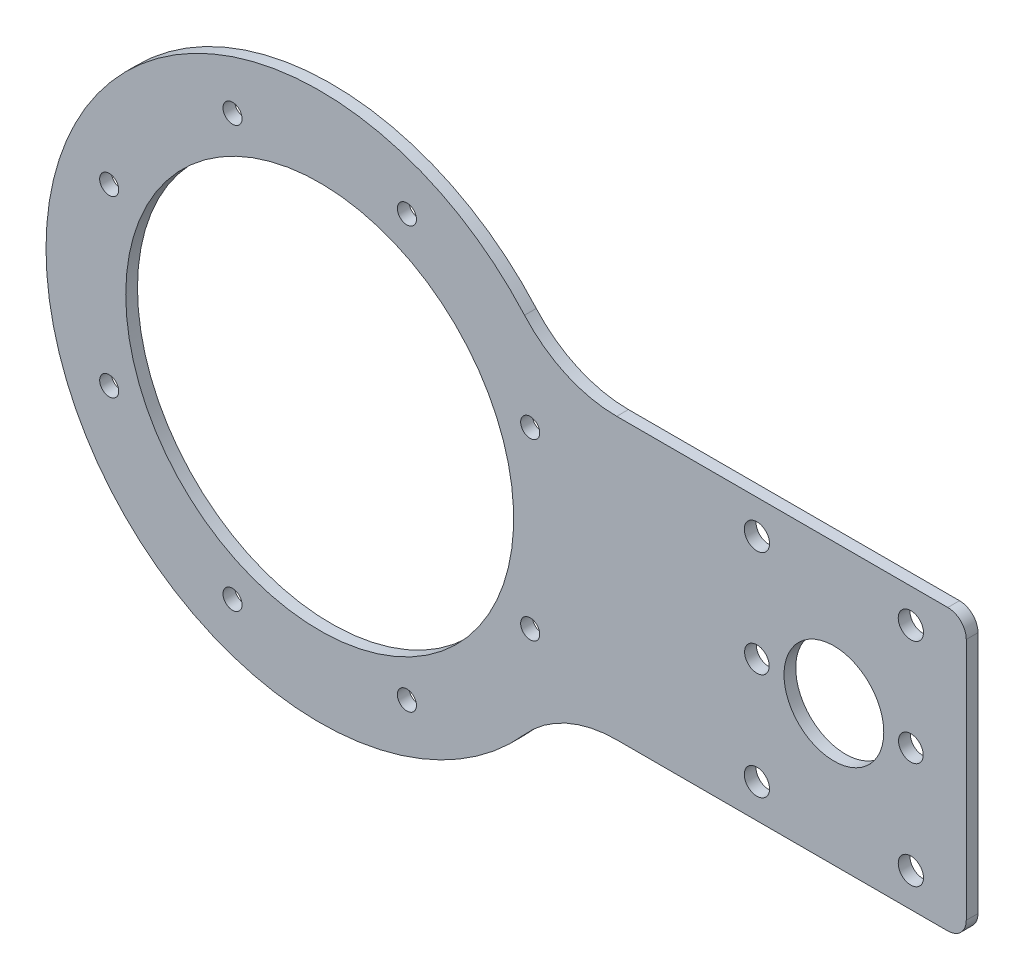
ISO-10303-21;
HEADER;
FILE_DESCRIPTION(('STEP AP214'),'2;1');
FILE_NAME('part.step','',(''),(''),'','','');
FILE_SCHEMA(('AUTOMOTIVE_DESIGN { 1 0 10303 214 1 1 1 1 }'));
ENDSEC;
DATA;
#1=APPLICATION_CONTEXT('core data for automotive mechanical design processes');
#2=APPLICATION_PROTOCOL_DEFINITION('international standard','automotive_design',2000,#1);
#3=PRODUCT_CONTEXT('',#1,'mechanical');
#4=PRODUCT('Part','Part','',(#3));
#5=PRODUCT_RELATED_PRODUCT_CATEGORY('part','',(#4));
#6=PRODUCT_DEFINITION_FORMATION('','',#4);
#7=PRODUCT_DEFINITION_CONTEXT('part definition',#1,'design');
#8=PRODUCT_DEFINITION('design','',#6,#7);
#9=PRODUCT_DEFINITION_SHAPE('','',#8);
#10=(LENGTH_UNIT() NAMED_UNIT(*) SI_UNIT(.MILLI.,.METRE.));
#11=(NAMED_UNIT(*) PLANE_ANGLE_UNIT() SI_UNIT($,.RADIAN.));
#12=(NAMED_UNIT(*) SI_UNIT($,.STERADIAN.) SOLID_ANGLE_UNIT());
#13=UNCERTAINTY_MEASURE_WITH_UNIT(LENGTH_MEASURE(1.E-05),#10,'distance_accuracy_value','');
#14=(GEOMETRIC_REPRESENTATION_CONTEXT(3) GLOBAL_UNCERTAINTY_ASSIGNED_CONTEXT((#13)) GLOBAL_UNIT_ASSIGNED_CONTEXT((#10,
#11,#12)) REPRESENTATION_CONTEXT('',''));
#15=CARTESIAN_POINT('',(0.,0.,0.));
#16=DIRECTION('',(0.,0.,1.));
#17=DIRECTION('',(1.,0.,0.));
#18=AXIS2_PLACEMENT_3D('',#15,#16,#17);
#19=CARTESIAN_POINT('',(0.,0.,1.905));
#20=DIRECTION('',(0.,0.,1.));
#21=DIRECTION('',(1.,0.,0.));
#22=AXIS2_PLACEMENT_3D('',#19,#20,#21);
#23=PLANE('',#22);
#24=CARTESIAN_POINT('',(83.5,0.,1.905));
#25=DIRECTION('',(0.,0.,1.));
#26=DIRECTION('',(1.,0.,0.));
#27=AXIS2_PLACEMENT_3D('',#24,#25,#26);
#28=CIRCLE('',#27,8.09999999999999);
#29=CARTESIAN_POINT('',(91.6,0.,1.905));
#30=VERTEX_POINT('',#29);
#31=EDGE_CURVE('E283',#30,#30,#28,.T.);
#32=ORIENTED_EDGE('',*,*,#31,.F.);
#33=EDGE_LOOP('',(#32));
#34=FACE_BOUND('',#33,.T.);
#35=CARTESIAN_POINT('',(71.,0.,1.905));
#36=DIRECTION('',(0.,0.,1.));
#37=DIRECTION('',(1.,0.,0.));
#38=AXIS2_PLACEMENT_3D('',#35,#36,#37);
#39=CIRCLE('',#38,2.);
#40=CARTESIAN_POINT('',(73.,0.,1.905));
#41=VERTEX_POINT('',#40);
#42=EDGE_CURVE('E278',#41,#41,#39,.T.);
#43=ORIENTED_EDGE('',*,*,#42,.F.);
#44=EDGE_LOOP('',(#43));
#45=FACE_BOUND('',#44,.T.);
#46=CARTESIAN_POINT('',(96.,0.,1.905));
#47=DIRECTION('',(0.,0.,1.));
#48=DIRECTION('',(1.,0.,0.));
#49=AXIS2_PLACEMENT_3D('',#46,#47,#48);
#50=CIRCLE('',#49,2.);
#51=CARTESIAN_POINT('',(98.,0.,1.905));
#52=VERTEX_POINT('',#51);
#53=EDGE_CURVE('E273',#52,#52,#50,.T.);
#54=ORIENTED_EDGE('',*,*,#53,.F.);
#55=EDGE_LOOP('',(#54));
#56=FACE_BOUND('',#55,.T.);
#57=CARTESIAN_POINT('',(34.1835427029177,-14.1592869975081,1.905));
#58=DIRECTION('',(0.,0.,1.));
#59=DIRECTION('',(1.,0.,0.));
#60=AXIS2_PLACEMENT_3D('',#57,#58,#59);
#61=CIRCLE('',#60,1.55);
#62=CARTESIAN_POINT('',(32.6335427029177,-14.1592869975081,1.905));
#63=VERTEX_POINT('',#62);
#64=EDGE_CURVE('E260',#63,#63,#61,.T.);
#65=ORIENTED_EDGE('',*,*,#64,.F.);
#66=EDGE_LOOP('',(#65));
#67=FACE_BOUND('',#66,.T.);
#68=CARTESIAN_POINT('',(14.1592869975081,34.1835427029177,1.905));
#69=DIRECTION('',(0.,0.,1.));
#70=DIRECTION('',(1.,0.,0.));
#71=AXIS2_PLACEMENT_3D('',#68,#69,#70);
#72=CIRCLE('',#71,1.55);
#73=CARTESIAN_POINT('',(12.6092869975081,34.1835427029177,1.905));
#74=VERTEX_POINT('',#73);
#75=EDGE_CURVE('E244',#74,#74,#72,.T.);
#76=ORIENTED_EDGE('',*,*,#75,.F.);
#77=EDGE_LOOP('',(#76));
#78=FACE_BOUND('',#77,.T.);
#79=CARTESIAN_POINT('',(-34.1835427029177,14.1592869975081,1.905));
#80=DIRECTION('',(0.,0.,1.));
#81=DIRECTION('',(1.,0.,0.));
#82=AXIS2_PLACEMENT_3D('',#79,#80,#81);
#83=CIRCLE('',#82,1.55);
#84=CARTESIAN_POINT('',(-35.7335427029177,14.1592869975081,1.905));
#85=VERTEX_POINT('',#84);
#86=EDGE_CURVE('E231',#85,#85,#83,.T.);
#87=ORIENTED_EDGE('',*,*,#86,.F.);
#88=EDGE_LOOP('',(#87));
#89=FACE_BOUND('',#88,.T.);
#90=CARTESIAN_POINT('',(-14.1592869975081,-34.1835427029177,1.905));
#91=DIRECTION('',(0.,0.,1.));
#92=DIRECTION('',(1.,0.,0.));
#93=AXIS2_PLACEMENT_3D('',#90,#91,#92);
#94=CIRCLE('',#93,1.55);
#95=CARTESIAN_POINT('',(-15.7092869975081,-34.1835427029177,1.905));
#96=VERTEX_POINT('',#95);
#97=EDGE_CURVE('E224',#96,#96,#94,.T.);
#98=ORIENTED_EDGE('',*,*,#97,.F.);
#99=EDGE_LOOP('',(#98));
#100=FACE_BOUND('',#99,.T.);
#101=CARTESIAN_POINT('',(71.,17.25,1.905));
#102=DIRECTION('',(0.,0.,1.));
#103=DIRECTION('',(1.,0.,0.));
#104=AXIS2_PLACEMENT_3D('',#101,#102,#103);
#105=CIRCLE('',#104,2.05);
#106=CARTESIAN_POINT('',(68.95,17.25,1.905));
#107=VERTEX_POINT('',#106);
#108=EDGE_CURVE('E209',#107,#107,#105,.T.);
#109=ORIENTED_EDGE('',*,*,#108,.F.);
#110=EDGE_LOOP('',(#109));
#111=FACE_BOUND('',#110,.T.);
#112=CARTESIAN_POINT('',(96.,17.25,1.905));
#113=DIRECTION('',(0.,0.,1.));
#114=DIRECTION('',(1.,0.,0.));
#115=AXIS2_PLACEMENT_3D('',#112,#113,#114);
#116=CIRCLE('',#115,2.05);
#117=CARTESIAN_POINT('',(93.95,17.25,1.905));
#118=VERTEX_POINT('',#117);
#119=EDGE_CURVE('E196',#118,#118,#116,.T.);
#120=ORIENTED_EDGE('',*,*,#119,.F.);
#121=EDGE_LOOP('',(#120));
#122=FACE_BOUND('',#121,.T.);
#123=DIRECTION('',(0.,1.,0.));
#124=VECTOR('',#123,1.);
#125=CARTESIAN_POINT('',(105.,-22.75,1.905));
#126=LINE('',#125,#124);
#127=CARTESIAN_POINT('',(105.,-19.75,1.905));
#128=VERTEX_POINT('',#127);
#129=CARTESIAN_POINT('',(105.,19.75,1.905));
#130=VERTEX_POINT('',#129);
#131=EDGE_CURVE('E148',#128,#130,#126,.T.);
#132=ORIENTED_EDGE('',*,*,#131,.T.);
#133=CARTESIAN_POINT('',(102.,19.75,1.905));
#134=DIRECTION('',(0.,0.,1.));
#135=DIRECTION('',(1.,0.,0.));
#136=AXIS2_PLACEMENT_3D('',#133,#134,#135);
#137=CIRCLE('',#136,3.);
#138=CARTESIAN_POINT('',(102.,22.75,1.905));
#139=VERTEX_POINT('',#138);
#140=EDGE_CURVE('E51',#130,#139,#137,.T.);
#141=ORIENTED_EDGE('',*,*,#140,.T.);
#142=DIRECTION('',(-1.,0.,0.));
#143=VECTOR('',#142,1.);
#144=CARTESIAN_POINT('',(38.1869087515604,22.75,1.905));
#145=LINE('',#144,#143);
#146=CARTESIAN_POINT('',(48.2311102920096,22.75,1.905));
#147=VERTEX_POINT('',#146);
#148=EDGE_CURVE('E147',#139,#147,#145,.T.);
#149=ORIENTED_EDGE('',*,*,#148,.T.);
#150=CARTESIAN_POINT('',(48.2311102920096,42.75,1.905));
#151=DIRECTION('',(0.,0.,1.));
#152=DIRECTION('',(1.,0.,0.));
#153=AXIS2_PLACEMENT_3D('',#150,#151,#152);
#154=CIRCLE('',#153,20.);
#155=CARTESIAN_POINT('',(33.2641249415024,29.483902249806,1.905));
#156=VERTEX_POINT('',#155);
#157=EDGE_CURVE('E122',#147,#156,#154,.F.);
#158=ORIENTED_EDGE('',*,*,#157,.T.);
#159=CARTESIAN_POINT('',(0.,0.,1.905));
#160=DIRECTION('',(0.,0.,1.));
#161=DIRECTION('',(1.,0.,0.));
#162=AXIS2_PLACEMENT_3D('',#159,#160,#161);
#163=CIRCLE('',#162,44.45);
#164=CARTESIAN_POINT('',(33.2641249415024,-29.483902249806,1.905));
#165=VERTEX_POINT('',#164);
#166=EDGE_CURVE('E134',#156,#165,#163,.T.);
#167=ORIENTED_EDGE('',*,*,#166,.T.);
#168=CARTESIAN_POINT('',(48.2311102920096,-42.75,1.905));
#169=DIRECTION('',(0.,0.,1.));
#170=DIRECTION('',(1.,0.,0.));
#171=AXIS2_PLACEMENT_3D('',#168,#169,#170);
#172=CIRCLE('',#171,20.);
#173=CARTESIAN_POINT('',(48.2311102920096,-22.75,1.905));
#174=VERTEX_POINT('',#173);
#175=EDGE_CURVE('E159',#165,#174,#172,.F.);
#176=ORIENTED_EDGE('',*,*,#175,.T.);
#177=DIRECTION('',(1.,0.,0.));
#178=VECTOR('',#177,1.);
#179=CARTESIAN_POINT('',(38.1869087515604,-22.75,1.905));
#180=LINE('',#179,#178);
#181=CARTESIAN_POINT('',(102.,-22.75,1.905));
#182=VERTEX_POINT('',#181);
#183=EDGE_CURVE('E190',#174,#182,#180,.T.);
#184=ORIENTED_EDGE('',*,*,#183,.T.);
#185=CARTESIAN_POINT('',(102.,-19.75,1.905));
#186=DIRECTION('',(0.,0.,1.));
#187=DIRECTION('',(1.,0.,0.));
#188=AXIS2_PLACEMENT_3D('',#185,#186,#187);
#189=CIRCLE('',#188,3.);
#190=EDGE_CURVE('E169',#182,#128,#189,.T.);
#191=ORIENTED_EDGE('',*,*,#190,.T.);
#192=EDGE_LOOP('',(#132,#141,#149,#158,#167,#176,#184,#191));
#193=FACE_BOUND('',#192,.T.);
#194=CARTESIAN_POINT('',(96.,-17.25,1.905));
#195=DIRECTION('',(0.,0.,1.));
#196=DIRECTION('',(1.,0.,0.));
#197=AXIS2_PLACEMENT_3D('',#194,#195,#196);
#198=CIRCLE('',#197,2.05);
#199=CARTESIAN_POINT('',(93.95,-17.25,1.905));
#200=VERTEX_POINT('',#199);
#201=EDGE_CURVE('E141',#200,#200,#198,.T.);
#202=ORIENTED_EDGE('',*,*,#201,.F.);
#203=EDGE_LOOP('',(#202));
#204=FACE_BOUND('',#203,.T.);
#205=CARTESIAN_POINT('',(71.,-17.25,1.905));
#206=DIRECTION('',(0.,0.,1.));
#207=DIRECTION('',(1.,0.,0.));
#208=AXIS2_PLACEMENT_3D('',#205,#206,#207);
#209=CIRCLE('',#208,2.05);
#210=CARTESIAN_POINT('',(68.95,-17.25,1.905));
#211=VERTEX_POINT('',#210);
#212=EDGE_CURVE('E205',#211,#211,#209,.T.);
#213=ORIENTED_EDGE('',*,*,#212,.F.);
#214=EDGE_LOOP('',(#213));
#215=FACE_BOUND('',#214,.T.);
#216=CARTESIAN_POINT('',(0.,0.,1.905));
#217=DIRECTION('',(0.,0.,1.));
#218=DIRECTION('',(1.,0.,0.));
#219=AXIS2_PLACEMENT_3D('',#216,#217,#218);
#220=CIRCLE('',#219,31.5);
#221=CARTESIAN_POINT('',(-31.5,0.,1.905));
#222=VERTEX_POINT('',#221);
#223=EDGE_CURVE('E214',#222,#222,#220,.T.);
#224=ORIENTED_EDGE('',*,*,#223,.F.);
#225=EDGE_LOOP('',(#224));
#226=FACE_BOUND('',#225,.T.);
#227=CARTESIAN_POINT('',(-34.1835427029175,-14.1592869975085,1.905));
#228=DIRECTION('',(0.,0.,1.));
#229=DIRECTION('',(1.,0.,0.));
#230=AXIS2_PLACEMENT_3D('',#227,#228,#229);
#231=CIRCLE('',#230,1.55);
#232=CARTESIAN_POINT('',(-35.7335427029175,-14.1592869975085,1.905));
#233=VERTEX_POINT('',#232);
#234=EDGE_CURVE('E227',#233,#233,#231,.T.);
#235=ORIENTED_EDGE('',*,*,#234,.F.);
#236=EDGE_LOOP('',(#235));
#237=FACE_BOUND('',#236,.T.);
#238=CARTESIAN_POINT('',(-14.1592869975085,34.1835427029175,1.905));
#239=DIRECTION('',(0.,0.,1.));
#240=DIRECTION('',(1.,0.,0.));
#241=AXIS2_PLACEMENT_3D('',#238,#239,#240);
#242=CIRCLE('',#241,1.55);
#243=CARTESIAN_POINT('',(-15.7092869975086,34.1835427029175,1.905));
#244=VERTEX_POINT('',#243);
#245=EDGE_CURVE('E237',#244,#244,#242,.T.);
#246=ORIENTED_EDGE('',*,*,#245,.F.);
#247=EDGE_LOOP('',(#246));
#248=FACE_BOUND('',#247,.T.);
#249=CARTESIAN_POINT('',(34.1835427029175,14.1592869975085,1.905));
#250=DIRECTION('',(0.,0.,1.));
#251=DIRECTION('',(1.,0.,0.));
#252=AXIS2_PLACEMENT_3D('',#249,#250,#251);
#253=CIRCLE('',#252,1.55);
#254=CARTESIAN_POINT('',(32.6335427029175,14.1592869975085,1.905));
#255=VERTEX_POINT('',#254);
#256=EDGE_CURVE('E252',#255,#255,#253,.T.);
#257=ORIENTED_EDGE('',*,*,#256,.F.);
#258=EDGE_LOOP('',(#257));
#259=FACE_BOUND('',#258,.T.);
#260=CARTESIAN_POINT('',(14.1592869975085,-34.1835427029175,1.905));
#261=DIRECTION('',(0.,0.,1.));
#262=DIRECTION('',(1.,0.,0.));
#263=AXIS2_PLACEMENT_3D('',#260,#261,#262);
#264=CIRCLE('',#263,1.55);
#265=CARTESIAN_POINT('',(12.6092869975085,-34.1835427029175,1.905));
#266=VERTEX_POINT('',#265);
#267=EDGE_CURVE('E265',#266,#266,#264,.T.);
#268=ORIENTED_EDGE('',*,*,#267,.F.);
#269=EDGE_LOOP('',(#268));
#270=FACE_BOUND('',#269,.T.);
#271=ADVANCED_FACE('F43',(#34,#45,#56,#67,#78,#89,#100,#111,#122,#193,#204,#215,#226,#237,#248,
#259,#270),#23,.T.);
#272=CARTESIAN_POINT('',(0.,0.,0.));
#273=DIRECTION('',(0.,0.,1.));
#274=DIRECTION('',(1.,0.,0.));
#275=AXIS2_PLACEMENT_3D('',#272,#273,#274);
#276=PLANE('',#275);
#277=CARTESIAN_POINT('',(83.5,0.,0.));
#278=DIRECTION('',(0.,0.,1.));
#279=DIRECTION('',(1.,0.,0.));
#280=AXIS2_PLACEMENT_3D('',#277,#278,#279);
#281=CIRCLE('',#280,8.09999999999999);
#282=CARTESIAN_POINT('',(91.6,0.,0.));
#283=VERTEX_POINT('',#282);
#284=EDGE_CURVE('E276',#283,#283,#281,.T.);
#285=ORIENTED_EDGE('',*,*,#284,.T.);
#286=EDGE_LOOP('',(#285));
#287=FACE_BOUND('',#286,.T.);
#288=CARTESIAN_POINT('',(71.,0.,0.));
#289=DIRECTION('',(0.,0.,1.));
#290=DIRECTION('',(1.,0.,0.));
#291=AXIS2_PLACEMENT_3D('',#288,#289,#290);
#292=CIRCLE('',#291,2.);
#293=CARTESIAN_POINT('',(73.,0.,0.));
#294=VERTEX_POINT('',#293);
#295=EDGE_CURVE('E268',#294,#294,#292,.T.);
#296=ORIENTED_EDGE('',*,*,#295,.T.);
#297=EDGE_LOOP('',(#296));
#298=FACE_BOUND('',#297,.T.);
#299=CARTESIAN_POINT('',(96.,0.,0.));
#300=DIRECTION('',(0.,0.,1.));
#301=DIRECTION('',(1.,0.,0.));
#302=AXIS2_PLACEMENT_3D('',#299,#300,#301);
#303=CIRCLE('',#302,2.);
#304=CARTESIAN_POINT('',(98.,0.,0.));
#305=VERTEX_POINT('',#304);
#306=EDGE_CURVE('E275',#305,#305,#303,.T.);
#307=ORIENTED_EDGE('',*,*,#306,.T.);
#308=EDGE_LOOP('',(#307));
#309=FACE_BOUND('',#308,.T.);
#310=DIRECTION('',(-1.,0.,0.));
#311=VECTOR('',#310,1.);
#312=CARTESIAN_POINT('',(38.1869087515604,22.75,0.));
#313=LINE('',#312,#311);
#314=CARTESIAN_POINT('',(102.,22.75,0.));
#315=VERTEX_POINT('',#314);
#316=CARTESIAN_POINT('',(48.2311102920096,22.75,0.));
#317=VERTEX_POINT('',#316);
#318=EDGE_CURVE('E138',#315,#317,#313,.T.);
#319=ORIENTED_EDGE('',*,*,#318,.F.);
#320=CARTESIAN_POINT('',(102.,19.75,0.));
#321=DIRECTION('',(0.,0.,1.));
#322=DIRECTION('',(1.,0.,0.));
#323=AXIS2_PLACEMENT_3D('',#320,#321,#322);
#324=CIRCLE('',#323,3.);
#325=CARTESIAN_POINT('',(105.,19.75,0.));
#326=VERTEX_POINT('',#325);
#327=EDGE_CURVE('E161',#315,#326,#324,.F.);
#328=ORIENTED_EDGE('',*,*,#327,.T.);
#329=DIRECTION('',(0.,1.,0.));
#330=VECTOR('',#329,1.);
#331=CARTESIAN_POINT('',(105.,-22.75,0.));
#332=LINE('',#331,#330);
#333=CARTESIAN_POINT('',(105.,-19.75,0.));
#334=VERTEX_POINT('',#333);
#335=EDGE_CURVE('E142',#334,#326,#332,.T.);
#336=ORIENTED_EDGE('',*,*,#335,.F.);
#337=CARTESIAN_POINT('',(102.,-19.75,0.));
#338=DIRECTION('',(0.,0.,1.));
#339=DIRECTION('',(1.,0.,0.));
#340=AXIS2_PLACEMENT_3D('',#337,#338,#339);
#341=CIRCLE('',#340,3.);
#342=CARTESIAN_POINT('',(102.,-22.75,0.));
#343=VERTEX_POINT('',#342);
#344=EDGE_CURVE('E163',#334,#343,#341,.F.);
#345=ORIENTED_EDGE('',*,*,#344,.T.);
#346=DIRECTION('',(1.,0.,0.));
#347=VECTOR('',#346,1.);
#348=CARTESIAN_POINT('',(38.1869087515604,-22.75,0.));
#349=LINE('',#348,#347);
#350=CARTESIAN_POINT('',(48.2311102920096,-22.75,0.));
#351=VERTEX_POINT('',#350);
#352=EDGE_CURVE('E140',#351,#343,#349,.T.);
#353=ORIENTED_EDGE('',*,*,#352,.F.);
#354=CARTESIAN_POINT('',(48.2311102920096,-42.75,0.));
#355=DIRECTION('',(0.,0.,1.));
#356=DIRECTION('',(1.,0.,0.));
#357=AXIS2_PLACEMENT_3D('',#354,#355,#356);
#358=CIRCLE('',#357,20.);
#359=CARTESIAN_POINT('',(33.2641249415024,-29.483902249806,0.));
#360=VERTEX_POINT('',#359);
#361=EDGE_CURVE('E136',#351,#360,#358,.T.);
#362=ORIENTED_EDGE('',*,*,#361,.T.);
#363=CARTESIAN_POINT('',(0.,0.,0.));
#364=DIRECTION('',(0.,0.,1.));
#365=DIRECTION('',(1.,0.,0.));
#366=AXIS2_PLACEMENT_3D('',#363,#364,#365);
#367=CIRCLE('',#366,44.45);
#368=CARTESIAN_POINT('',(33.2641249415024,29.483902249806,0.));
#369=VERTEX_POINT('',#368);
#370=EDGE_CURVE('E127',#369,#360,#367,.T.);
#371=ORIENTED_EDGE('',*,*,#370,.F.);
#372=CARTESIAN_POINT('',(48.2311102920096,42.75,0.));
#373=DIRECTION('',(0.,0.,1.));
#374=DIRECTION('',(1.,0.,0.));
#375=AXIS2_PLACEMENT_3D('',#372,#373,#374);
#376=CIRCLE('',#375,20.);
#377=EDGE_CURVE('E111',#369,#317,#376,.T.);
#378=ORIENTED_EDGE('',*,*,#377,.T.);
#379=EDGE_LOOP('',(#319,#328,#336,#345,#353,#362,#371,#378));
#380=FACE_BOUND('',#379,.T.);
#381=CARTESIAN_POINT('',(96.,-17.25,0.));
#382=DIRECTION('',(0.,0.,1.));
#383=DIRECTION('',(1.,0.,0.));
#384=AXIS2_PLACEMENT_3D('',#381,#382,#383);
#385=CIRCLE('',#384,2.05);
#386=CARTESIAN_POINT('',(93.95,-17.25,0.));
#387=VERTEX_POINT('',#386);
#388=EDGE_CURVE('E193',#387,#387,#385,.T.);
#389=ORIENTED_EDGE('',*,*,#388,.T.);
#390=EDGE_LOOP('',(#389));
#391=FACE_BOUND('',#390,.T.);
#392=CARTESIAN_POINT('',(96.,17.25,0.));
#393=DIRECTION('',(0.,0.,1.));
#394=DIRECTION('',(1.,0.,0.));
#395=AXIS2_PLACEMENT_3D('',#392,#393,#394);
#396=CIRCLE('',#395,2.05);
#397=CARTESIAN_POINT('',(93.95,17.25,0.));
#398=VERTEX_POINT('',#397);
#399=EDGE_CURVE('E197',#398,#398,#396,.T.);
#400=ORIENTED_EDGE('',*,*,#399,.T.);
#401=EDGE_LOOP('',(#400));
#402=FACE_BOUND('',#401,.T.);
#403=CARTESIAN_POINT('',(71.,-17.25,0.));
#404=DIRECTION('',(0.,0.,1.));
#405=DIRECTION('',(1.,0.,0.));
#406=AXIS2_PLACEMENT_3D('',#403,#404,#405);
#407=CIRCLE('',#406,2.05);
#408=CARTESIAN_POINT('',(68.95,-17.25,0.));
#409=VERTEX_POINT('',#408);
#410=EDGE_CURVE('E207',#409,#409,#407,.T.);
#411=ORIENTED_EDGE('',*,*,#410,.T.);
#412=EDGE_LOOP('',(#411));
#413=FACE_BOUND('',#412,.T.);
#414=CARTESIAN_POINT('',(71.,17.25,0.));
#415=DIRECTION('',(0.,0.,1.));
#416=DIRECTION('',(1.,0.,0.));
#417=AXIS2_PLACEMENT_3D('',#414,#415,#416);
#418=CIRCLE('',#417,2.05);
#419=CARTESIAN_POINT('',(68.95,17.25,0.));
#420=VERTEX_POINT('',#419);
#421=EDGE_CURVE('E215',#420,#420,#418,.T.);
#422=ORIENTED_EDGE('',*,*,#421,.T.);
#423=EDGE_LOOP('',(#422));
#424=FACE_BOUND('',#423,.T.);
#425=CARTESIAN_POINT('',(0.,0.,0.));
#426=DIRECTION('',(0.,0.,1.));
#427=DIRECTION('',(1.,0.,0.));
#428=AXIS2_PLACEMENT_3D('',#425,#426,#427);
#429=CIRCLE('',#428,31.5);
#430=CARTESIAN_POINT('',(-31.5,0.,0.));
#431=VERTEX_POINT('',#430);
#432=EDGE_CURVE('E220',#431,#431,#429,.T.);
#433=ORIENTED_EDGE('',*,*,#432,.T.);
#434=EDGE_LOOP('',(#433));
#435=FACE_BOUND('',#434,.T.);
#436=CARTESIAN_POINT('',(-14.1592869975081,-34.1835427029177,0.));
#437=DIRECTION('',(0.,0.,1.));
#438=DIRECTION('',(1.,0.,0.));
#439=AXIS2_PLACEMENT_3D('',#436,#437,#438);
#440=CIRCLE('',#439,1.55);
#441=CARTESIAN_POINT('',(-15.7092869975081,-34.1835427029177,0.));
#442=VERTEX_POINT('',#441);
#443=EDGE_CURVE('E223',#442,#442,#440,.T.);
#444=ORIENTED_EDGE('',*,*,#443,.T.);
#445=EDGE_LOOP('',(#444));
#446=FACE_BOUND('',#445,.T.);
#447=CARTESIAN_POINT('',(-34.1835427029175,-14.1592869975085,0.));
#448=DIRECTION('',(0.,0.,1.));
#449=DIRECTION('',(1.,0.,0.));
#450=AXIS2_PLACEMENT_3D('',#447,#448,#449);
#451=CIRCLE('',#450,1.55);
#452=CARTESIAN_POINT('',(-35.7335427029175,-14.1592869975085,0.));
#453=VERTEX_POINT('',#452);
#454=EDGE_CURVE('E229',#453,#453,#451,.T.);
#455=ORIENTED_EDGE('',*,*,#454,.T.);
#456=EDGE_LOOP('',(#455));
#457=FACE_BOUND('',#456,.T.);
#458=CARTESIAN_POINT('',(-34.1835427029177,14.1592869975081,0.));
#459=DIRECTION('',(0.,0.,1.));
#460=DIRECTION('',(1.,0.,0.));
#461=AXIS2_PLACEMENT_3D('',#458,#459,#460);
#462=CIRCLE('',#461,1.55);
#463=CARTESIAN_POINT('',(-35.7335427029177,14.1592869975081,0.));
#464=VERTEX_POINT('',#463);
#465=EDGE_CURVE('E236',#464,#464,#462,.T.);
#466=ORIENTED_EDGE('',*,*,#465,.T.);
#467=EDGE_LOOP('',(#466));
#468=FACE_BOUND('',#467,.T.);
#469=CARTESIAN_POINT('',(-14.1592869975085,34.1835427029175,0.));
#470=DIRECTION('',(0.,0.,1.));
#471=DIRECTION('',(1.,0.,0.));
#472=AXIS2_PLACEMENT_3D('',#469,#470,#471);
#473=CIRCLE('',#472,1.55);
#474=CARTESIAN_POINT('',(-15.7092869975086,34.1835427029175,0.));
#475=VERTEX_POINT('',#474);
#476=EDGE_CURVE('E245',#475,#475,#473,.T.);
#477=ORIENTED_EDGE('',*,*,#476,.T.);
#478=EDGE_LOOP('',(#477));
#479=FACE_BOUND('',#478,.T.);
#480=CARTESIAN_POINT('',(14.1592869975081,34.1835427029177,0.));
#481=DIRECTION('',(0.,0.,1.));
#482=DIRECTION('',(1.,0.,0.));
#483=AXIS2_PLACEMENT_3D('',#480,#481,#482);
#484=CIRCLE('',#483,1.55);
#485=CARTESIAN_POINT('',(12.6092869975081,34.1835427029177,0.));
#486=VERTEX_POINT('',#485);
#487=EDGE_CURVE('E247',#486,#486,#484,.T.);
#488=ORIENTED_EDGE('',*,*,#487,.T.);
#489=EDGE_LOOP('',(#488));
#490=FACE_BOUND('',#489,.T.);
#491=CARTESIAN_POINT('',(34.1835427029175,14.1592869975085,0.));
#492=DIRECTION('',(0.,0.,1.));
#493=DIRECTION('',(1.,0.,0.));
#494=AXIS2_PLACEMENT_3D('',#491,#492,#493);
#495=CIRCLE('',#494,1.55);
#496=CARTESIAN_POINT('',(32.6335427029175,14.1592869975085,0.));
#497=VERTEX_POINT('',#496);
#498=EDGE_CURVE('E251',#497,#497,#495,.T.);
#499=ORIENTED_EDGE('',*,*,#498,.T.);
#500=EDGE_LOOP('',(#499));
#501=FACE_BOUND('',#500,.T.);
#502=CARTESIAN_POINT('',(34.1835427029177,-14.1592869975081,0.));
#503=DIRECTION('',(0.,0.,1.));
#504=DIRECTION('',(1.,0.,0.));
#505=AXIS2_PLACEMENT_3D('',#502,#503,#504);
#506=CIRCLE('',#505,1.55);
#507=CARTESIAN_POINT('',(32.6335427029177,-14.1592869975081,0.));
#508=VERTEX_POINT('',#507);
#509=EDGE_CURVE('E259',#508,#508,#506,.T.);
#510=ORIENTED_EDGE('',*,*,#509,.T.);
#511=EDGE_LOOP('',(#510));
#512=FACE_BOUND('',#511,.T.);
#513=CARTESIAN_POINT('',(14.1592869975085,-34.1835427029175,0.));
#514=DIRECTION('',(0.,0.,1.));
#515=DIRECTION('',(1.,0.,0.));
#516=AXIS2_PLACEMENT_3D('',#513,#514,#515);
#517=CIRCLE('',#516,1.55);
#518=CARTESIAN_POINT('',(12.6092869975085,-34.1835427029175,0.));
#519=VERTEX_POINT('',#518);
#520=EDGE_CURVE('E269',#519,#519,#517,.T.);
#521=ORIENTED_EDGE('',*,*,#520,.T.);
#522=EDGE_LOOP('',(#521));
#523=FACE_BOUND('',#522,.T.);
#524=ADVANCED_FACE('F133',(#287,#298,#309,#380,#391,#402,#413,#424,#435,#446,#457,#468,#479,
#490,#501,#512,#523),#276,.F.);
#525=CARTESIAN_POINT('',(38.1869087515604,22.75,1.905));
#526=DIRECTION('',(0.,-1.,0.));
#527=DIRECTION('',(1.,0.,0.));
#528=AXIS2_PLACEMENT_3D('',#525,#526,#527);
#529=PLANE('',#528);
#530=ORIENTED_EDGE('',*,*,#148,.F.);
#531=DIRECTION('',(0.,0.,-1.));
#532=VECTOR('',#531,1.);
#533=CARTESIAN_POINT('',(102.,22.75,1.905));
#534=LINE('',#533,#532);
#535=EDGE_CURVE('E160',#139,#315,#534,.T.);
#536=ORIENTED_EDGE('',*,*,#535,.T.);
#537=ORIENTED_EDGE('',*,*,#318,.T.);
#538=DIRECTION('',(0.,0.,1.));
#539=VECTOR('',#538,1.);
#540=CARTESIAN_POINT('',(48.2311102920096,22.75,1.905));
#541=LINE('',#540,#539);
#542=EDGE_CURVE('E120',#317,#147,#541,.T.);
#543=ORIENTED_EDGE('',*,*,#542,.T.);
#544=EDGE_LOOP('',(#530,#536,#537,#543));
#545=FACE_BOUND('',#544,.T.);
#546=ADVANCED_FACE('F180',(#545),#529,.F.);
#547=CARTESIAN_POINT('',(0.,0.,1.905));
#548=DIRECTION('',(0.,0.,-1.));
#549=DIRECTION('',(-1.,0.,0.));
#550=AXIS2_PLACEMENT_3D('',#547,#548,#549);
#551=CYLINDRICAL_SURFACE('',#550,44.45);
#552=ORIENTED_EDGE('',*,*,#166,.F.);
#553=DIRECTION('',(0.,0.,-1.));
#554=VECTOR('',#553,1.);
#555=CARTESIAN_POINT('',(33.2641249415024,29.483902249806,1.905));
#556=LINE('',#555,#554);
#557=EDGE_CURVE('E114',#156,#369,#556,.T.);
#558=ORIENTED_EDGE('',*,*,#557,.T.);
#559=ORIENTED_EDGE('',*,*,#370,.T.);
#560=DIRECTION('',(0.,0.,-1.));
#561=VECTOR('',#560,1.);
#562=CARTESIAN_POINT('',(33.2641249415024,-29.483902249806,1.905));
#563=LINE('',#562,#561);
#564=EDGE_CURVE('E131',#360,#165,#563,.F.);
#565=ORIENTED_EDGE('',*,*,#564,.T.);
#566=EDGE_LOOP('',(#552,#558,#559,#565));
#567=FACE_BOUND('',#566,.T.);
#568=ADVANCED_FACE('F130',(#567),#551,.T.);
#569=CARTESIAN_POINT('',(38.1869087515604,-22.75,1.905));
#570=DIRECTION('',(0.,1.,0.));
#571=DIRECTION('',(-1.,0.,0.));
#572=AXIS2_PLACEMENT_3D('',#569,#570,#571);
#573=PLANE('',#572);
#574=ORIENTED_EDGE('',*,*,#352,.T.);
#575=DIRECTION('',(0.,0.,-1.));
#576=VECTOR('',#575,1.);
#577=CARTESIAN_POINT('',(102.,-22.75,1.905));
#578=LINE('',#577,#576);
#579=EDGE_CURVE('E11',#343,#182,#578,.F.);
#580=ORIENTED_EDGE('',*,*,#579,.T.);
#581=ORIENTED_EDGE('',*,*,#183,.F.);
#582=DIRECTION('',(0.,0.,1.));
#583=VECTOR('',#582,1.);
#584=CARTESIAN_POINT('',(48.2311102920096,-22.75,0.));
#585=LINE('',#584,#583);
#586=EDGE_CURVE('E125',#174,#351,#585,.F.);
#587=ORIENTED_EDGE('',*,*,#586,.T.);
#588=EDGE_LOOP('',(#574,#580,#581,#587));
#589=FACE_BOUND('',#588,.T.);
#590=ADVANCED_FACE('F184',(#589),#573,.F.);
#591=CARTESIAN_POINT('',(105.,-22.75,1.905));
#592=DIRECTION('',(-1.,0.,0.));
#593=DIRECTION('',(0.,0.,1.));
#594=AXIS2_PLACEMENT_3D('',#591,#592,#593);
#595=PLANE('',#594);
#596=ORIENTED_EDGE('',*,*,#335,.T.);
#597=DIRECTION('',(0.,0.,-1.));
#598=VECTOR('',#597,1.);
#599=CARTESIAN_POINT('',(105.,19.75,1.905));
#600=LINE('',#599,#598);
#601=EDGE_CURVE('E63',#326,#130,#600,.F.);
#602=ORIENTED_EDGE('',*,*,#601,.T.);
#603=ORIENTED_EDGE('',*,*,#131,.F.);
#604=DIRECTION('',(0.,0.,-1.));
#605=VECTOR('',#604,1.);
#606=CARTESIAN_POINT('',(105.,-19.75,1.905));
#607=LINE('',#606,#605);
#608=EDGE_CURVE('E164',#128,#334,#607,.T.);
#609=ORIENTED_EDGE('',*,*,#608,.T.);
#610=EDGE_LOOP('',(#596,#602,#603,#609));
#611=FACE_BOUND('',#610,.T.);
#612=ADVANCED_FACE('F181',(#611),#595,.F.);
#613=CARTESIAN_POINT('',(96.,-17.25,1.905));
#614=DIRECTION('',(0.,0.,-1.));
#615=DIRECTION('',(-1.,0.,0.));
#616=AXIS2_PLACEMENT_3D('',#613,#614,#615);
#617=CYLINDRICAL_SURFACE('',#616,2.05);
#618=CARTESIAN_POINT('',(93.95,-17.25,1.905));
#619=CARTESIAN_POINT('',(93.95,-17.25,1.88515625));
#620=CARTESIAN_POINT('',(93.95,-17.25,1.8653125));
#621=CARTESIAN_POINT('',(93.95,-17.25,1.825625));
#622=CARTESIAN_POINT('',(93.95,-17.25,1.80578125));
#623=CARTESIAN_POINT('',(93.95,-17.25,1.76609375));
#624=CARTESIAN_POINT('',(93.95,-17.25,1.74625));
#625=CARTESIAN_POINT('',(93.95,-17.25,1.7065625));
#626=CARTESIAN_POINT('',(93.95,-17.25,1.68671875));
#627=CARTESIAN_POINT('',(93.95,-17.25,1.64703125));
#628=CARTESIAN_POINT('',(93.95,-17.25,1.6271875));
#629=CARTESIAN_POINT('',(93.95,-17.25,1.5875));
#630=CARTESIAN_POINT('',(93.95,-17.25,1.56765625));
#631=CARTESIAN_POINT('',(93.95,-17.25,1.52796875));
#632=CARTESIAN_POINT('',(93.95,-17.25,1.508125));
#633=CARTESIAN_POINT('',(93.95,-17.25,1.4684375));
#634=CARTESIAN_POINT('',(93.95,-17.25,1.44859375));
#635=CARTESIAN_POINT('',(93.95,-17.25,1.40890625));
#636=CARTESIAN_POINT('',(93.95,-17.25,1.3890625));
#637=CARTESIAN_POINT('',(93.95,-17.25,1.349375));
#638=CARTESIAN_POINT('',(93.95,-17.25,1.32953125));
#639=CARTESIAN_POINT('',(93.95,-17.25,1.28984375));
#640=CARTESIAN_POINT('',(93.95,-17.25,1.27));
#641=CARTESIAN_POINT('',(93.95,-17.25,1.2303125));
#642=CARTESIAN_POINT('',(93.95,-17.25,1.21046875));
#643=CARTESIAN_POINT('',(93.95,-17.25,1.17078125));
#644=CARTESIAN_POINT('',(93.95,-17.25,1.1509375));
#645=CARTESIAN_POINT('',(93.95,-17.25,1.11125));
#646=CARTESIAN_POINT('',(93.95,-17.25,1.09140625));
#647=CARTESIAN_POINT('',(93.95,-17.25,1.05171875));
#648=CARTESIAN_POINT('',(93.95,-17.25,1.031875));
#649=CARTESIAN_POINT('',(93.95,-17.25,0.9921875));
#650=CARTESIAN_POINT('',(93.95,-17.25,0.97234375));
#651=CARTESIAN_POINT('',(93.95,-17.25,0.93265625));
#652=CARTESIAN_POINT('',(93.95,-17.25,0.9128125));
#653=CARTESIAN_POINT('',(93.95,-17.25,0.873125));
#654=CARTESIAN_POINT('',(93.95,-17.25,0.85328125));
#655=CARTESIAN_POINT('',(93.95,-17.25,0.81359375));
#656=CARTESIAN_POINT('',(93.95,-17.25,0.79375));
#657=CARTESIAN_POINT('',(93.95,-17.25,0.7540625));
#658=CARTESIAN_POINT('',(93.95,-17.25,0.73421875));
#659=CARTESIAN_POINT('',(93.95,-17.25,0.69453125));
#660=CARTESIAN_POINT('',(93.95,-17.25,0.6746875));
#661=CARTESIAN_POINT('',(93.95,-17.25,0.635));
#662=CARTESIAN_POINT('',(93.95,-17.25,0.61515625));
#663=CARTESIAN_POINT('',(93.95,-17.25,0.57546875));
#664=CARTESIAN_POINT('',(93.95,-17.25,0.555625));
#665=CARTESIAN_POINT('',(93.95,-17.25,0.5159375));
#666=CARTESIAN_POINT('',(93.95,-17.25,0.49609375));
#667=CARTESIAN_POINT('',(93.95,-17.25,0.45640625));
#668=CARTESIAN_POINT('',(93.95,-17.25,0.4365625));
#669=CARTESIAN_POINT('',(93.95,-17.25,0.396875));
#670=CARTESIAN_POINT('',(93.95,-17.25,0.37703125));
#671=CARTESIAN_POINT('',(93.95,-17.25,0.33734375));
#672=CARTESIAN_POINT('',(93.95,-17.25,0.3175));
#673=CARTESIAN_POINT('',(93.95,-17.25,0.2778125));
#674=CARTESIAN_POINT('',(93.95,-17.25,0.25796875));
#675=CARTESIAN_POINT('',(93.95,-17.25,0.21828125));
#676=CARTESIAN_POINT('',(93.95,-17.25,0.1984375));
#677=CARTESIAN_POINT('',(93.95,-17.25,0.15875));
#678=CARTESIAN_POINT('',(93.95,-17.25,0.13890625));
#679=CARTESIAN_POINT('',(93.95,-17.25,0.09921875));
#680=CARTESIAN_POINT('',(93.95,-17.25,0.0793749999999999));
#681=CARTESIAN_POINT('',(93.95,-17.25,0.0396874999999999));
#682=CARTESIAN_POINT('',(93.95,-17.25,0.01984375));
#683=CARTESIAN_POINT('',(93.95,-17.25,0.));
#684=B_SPLINE_CURVE_WITH_KNOTS('',3,(#618,#619,#620,#621,#622,#623,#624,#625,#626,#627,#628,
#629,#630,#631,#632,#633,#634,#635,#636,#637,#638,#639,#640,#641,#642,#643,#644,#645,#646,#647,
#648,#649,#650,#651,#652,#653,#654,#655,#656,#657,#658,#659,#660,#661,#662,#663,#664,#665,#666,
#667,#668,#669,#670,#671,#672,#673,#674,#675,#676,#677,#678,#679,#680,#681,#682,#683),
.UNSPECIFIED.,.F.,.F.,(4,2,2,2,2,2,2,2,2,2,2,2,2,2,2,2,2,2,2,2,2,2,2,2,2,2,2,2,2,2,2,2,4),(0.,
0.0595312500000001,0.1190625,0.17859375,0.238125,0.29765625,0.3571875,0.41671875,0.47625,
0.53578125,0.5953125,0.65484375,0.714375,0.77390625,0.8334375,0.89296875,0.9525,1.01203125,
1.0715625,1.13109375,1.190625,1.25015625,1.3096875,1.36921875,1.42875,1.48828125,1.5478125,
1.60734375,1.666875,1.72640625,1.7859375,1.84546875,1.905),.UNSPECIFIED.);
#685=EDGE_CURVE('BSEAM325',#200,#387,#684,.T.);
#686=ORIENTED_EDGE('',*,*,#201,.T.);
#687=ORIENTED_EDGE('',*,*,#388,.F.);
#688=ORIENTED_EDGE('',*,*,#685,.T.);
#689=ORIENTED_EDGE('',*,*,#685,.F.);
#690=EDGE_LOOP('',(#686,#688,#687,#689));
#691=FACE_BOUND('',#690,.T.);
#692=ADVANCED_FACE('F325',(#691),#617,.F.);
#693=CARTESIAN_POINT('',(96.,17.25,1.905));
#694=DIRECTION('',(0.,0.,-1.));
#695=DIRECTION('',(-1.,0.,0.));
#696=AXIS2_PLACEMENT_3D('',#693,#694,#695);
#697=CYLINDRICAL_SURFACE('',#696,2.05);
#698=CARTESIAN_POINT('',(93.95,17.25,1.905));
#699=CARTESIAN_POINT('',(93.95,17.25,1.88515625));
#700=CARTESIAN_POINT('',(93.95,17.25,1.8653125));
#701=CARTESIAN_POINT('',(93.95,17.25,1.825625));
#702=CARTESIAN_POINT('',(93.95,17.25,1.80578125));
#703=CARTESIAN_POINT('',(93.95,17.25,1.76609375));
#704=CARTESIAN_POINT('',(93.95,17.25,1.74625));
#705=CARTESIAN_POINT('',(93.95,17.25,1.7065625));
#706=CARTESIAN_POINT('',(93.95,17.25,1.68671875));
#707=CARTESIAN_POINT('',(93.95,17.25,1.64703125));
#708=CARTESIAN_POINT('',(93.95,17.25,1.6271875));
#709=CARTESIAN_POINT('',(93.95,17.25,1.5875));
#710=CARTESIAN_POINT('',(93.95,17.25,1.56765625));
#711=CARTESIAN_POINT('',(93.95,17.25,1.52796875));
#712=CARTESIAN_POINT('',(93.95,17.25,1.508125));
#713=CARTESIAN_POINT('',(93.95,17.25,1.4684375));
#714=CARTESIAN_POINT('',(93.95,17.25,1.44859375));
#715=CARTESIAN_POINT('',(93.95,17.25,1.40890625));
#716=CARTESIAN_POINT('',(93.95,17.25,1.3890625));
#717=CARTESIAN_POINT('',(93.95,17.25,1.349375));
#718=CARTESIAN_POINT('',(93.95,17.25,1.32953125));
#719=CARTESIAN_POINT('',(93.95,17.25,1.28984375));
#720=CARTESIAN_POINT('',(93.95,17.25,1.27));
#721=CARTESIAN_POINT('',(93.95,17.25,1.2303125));
#722=CARTESIAN_POINT('',(93.95,17.25,1.21046875));
#723=CARTESIAN_POINT('',(93.95,17.25,1.17078125));
#724=CARTESIAN_POINT('',(93.95,17.25,1.1509375));
#725=CARTESIAN_POINT('',(93.95,17.25,1.11125));
#726=CARTESIAN_POINT('',(93.95,17.25,1.09140625));
#727=CARTESIAN_POINT('',(93.95,17.25,1.05171875));
#728=CARTESIAN_POINT('',(93.95,17.25,1.031875));
#729=CARTESIAN_POINT('',(93.95,17.25,0.9921875));
#730=CARTESIAN_POINT('',(93.95,17.25,0.97234375));
#731=CARTESIAN_POINT('',(93.95,17.25,0.93265625));
#732=CARTESIAN_POINT('',(93.95,17.25,0.9128125));
#733=CARTESIAN_POINT('',(93.95,17.25,0.873125));
#734=CARTESIAN_POINT('',(93.95,17.25,0.85328125));
#735=CARTESIAN_POINT('',(93.95,17.25,0.81359375));
#736=CARTESIAN_POINT('',(93.95,17.25,0.79375));
#737=CARTESIAN_POINT('',(93.95,17.25,0.7540625));
#738=CARTESIAN_POINT('',(93.95,17.25,0.73421875));
#739=CARTESIAN_POINT('',(93.95,17.25,0.69453125));
#740=CARTESIAN_POINT('',(93.95,17.25,0.6746875));
#741=CARTESIAN_POINT('',(93.95,17.25,0.635));
#742=CARTESIAN_POINT('',(93.95,17.25,0.61515625));
#743=CARTESIAN_POINT('',(93.95,17.25,0.57546875));
#744=CARTESIAN_POINT('',(93.95,17.25,0.555625));
#745=CARTESIAN_POINT('',(93.95,17.25,0.5159375));
#746=CARTESIAN_POINT('',(93.95,17.25,0.49609375));
#747=CARTESIAN_POINT('',(93.95,17.25,0.45640625));
#748=CARTESIAN_POINT('',(93.95,17.25,0.4365625));
#749=CARTESIAN_POINT('',(93.95,17.25,0.396875));
#750=CARTESIAN_POINT('',(93.95,17.25,0.37703125));
#751=CARTESIAN_POINT('',(93.95,17.25,0.33734375));
#752=CARTESIAN_POINT('',(93.95,17.25,0.3175));
#753=CARTESIAN_POINT('',(93.95,17.25,0.2778125));
#754=CARTESIAN_POINT('',(93.95,17.25,0.25796875));
#755=CARTESIAN_POINT('',(93.95,17.25,0.21828125));
#756=CARTESIAN_POINT('',(93.95,17.25,0.1984375));
#757=CARTESIAN_POINT('',(93.95,17.25,0.15875));
#758=CARTESIAN_POINT('',(93.95,17.25,0.13890625));
#759=CARTESIAN_POINT('',(93.95,17.25,0.09921875));
#760=CARTESIAN_POINT('',(93.95,17.25,0.0793749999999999));
#761=CARTESIAN_POINT('',(93.95,17.25,0.0396874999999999));
#762=CARTESIAN_POINT('',(93.95,17.25,0.01984375));
#763=CARTESIAN_POINT('',(93.95,17.25,0.));
#764=B_SPLINE_CURVE_WITH_KNOTS('',3,(#698,#699,#700,#701,#702,#703,#704,#705,#706,#707,#708,
#709,#710,#711,#712,#713,#714,#715,#716,#717,#718,#719,#720,#721,#722,#723,#724,#725,#726,#727,
#728,#729,#730,#731,#732,#733,#734,#735,#736,#737,#738,#739,#740,#741,#742,#743,#744,#745,#746,
#747,#748,#749,#750,#751,#752,#753,#754,#755,#756,#757,#758,#759,#760,#761,#762,#763),
.UNSPECIFIED.,.F.,.F.,(4,2,2,2,2,2,2,2,2,2,2,2,2,2,2,2,2,2,2,2,2,2,2,2,2,2,2,2,2,2,2,2,4),(0.,
0.0595312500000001,0.1190625,0.17859375,0.238125,0.29765625,0.3571875,0.41671875,0.47625,
0.53578125,0.5953125,0.65484375,0.714375,0.77390625,0.8334375,0.89296875,0.9525,1.01203125,
1.0715625,1.13109375,1.190625,1.25015625,1.3096875,1.36921875,1.42875,1.48828125,1.5478125,
1.60734375,1.666875,1.72640625,1.7859375,1.84546875,1.905),.UNSPECIFIED.);
#765=EDGE_CURVE('BSEAM319',#118,#398,#764,.T.);
#766=ORIENTED_EDGE('',*,*,#119,.T.);
#767=ORIENTED_EDGE('',*,*,#399,.F.);
#768=ORIENTED_EDGE('',*,*,#765,.T.);
#769=ORIENTED_EDGE('',*,*,#765,.F.);
#770=EDGE_LOOP('',(#766,#768,#767,#769));
#771=FACE_BOUND('',#770,.T.);
#772=ADVANCED_FACE('F319',(#771),#697,.F.);
#773=CARTESIAN_POINT('',(71.,-17.25,1.905));
#774=DIRECTION('',(0.,0.,-1.));
#775=DIRECTION('',(-1.,0.,0.));
#776=AXIS2_PLACEMENT_3D('',#773,#774,#775);
#777=CYLINDRICAL_SURFACE('',#776,2.05);
#778=CARTESIAN_POINT('',(68.95,-17.25,1.905));
#779=CARTESIAN_POINT('',(68.95,-17.25,1.88515625));
#780=CARTESIAN_POINT('',(68.95,-17.25,1.8653125));
#781=CARTESIAN_POINT('',(68.95,-17.25,1.825625));
#782=CARTESIAN_POINT('',(68.95,-17.25,1.80578125));
#783=CARTESIAN_POINT('',(68.95,-17.25,1.76609375));
#784=CARTESIAN_POINT('',(68.95,-17.25,1.74625));
#785=CARTESIAN_POINT('',(68.95,-17.25,1.7065625));
#786=CARTESIAN_POINT('',(68.95,-17.25,1.68671875));
#787=CARTESIAN_POINT('',(68.95,-17.25,1.64703125));
#788=CARTESIAN_POINT('',(68.95,-17.25,1.6271875));
#789=CARTESIAN_POINT('',(68.95,-17.25,1.5875));
#790=CARTESIAN_POINT('',(68.95,-17.25,1.56765625));
#791=CARTESIAN_POINT('',(68.95,-17.25,1.52796875));
#792=CARTESIAN_POINT('',(68.95,-17.25,1.508125));
#793=CARTESIAN_POINT('',(68.95,-17.25,1.4684375));
#794=CARTESIAN_POINT('',(68.95,-17.25,1.44859375));
#795=CARTESIAN_POINT('',(68.95,-17.25,1.40890625));
#796=CARTESIAN_POINT('',(68.95,-17.25,1.3890625));
#797=CARTESIAN_POINT('',(68.95,-17.25,1.349375));
#798=CARTESIAN_POINT('',(68.95,-17.25,1.32953125));
#799=CARTESIAN_POINT('',(68.95,-17.25,1.28984375));
#800=CARTESIAN_POINT('',(68.95,-17.25,1.27));
#801=CARTESIAN_POINT('',(68.95,-17.25,1.2303125));
#802=CARTESIAN_POINT('',(68.95,-17.25,1.21046875));
#803=CARTESIAN_POINT('',(68.95,-17.25,1.17078125));
#804=CARTESIAN_POINT('',(68.95,-17.25,1.1509375));
#805=CARTESIAN_POINT('',(68.95,-17.25,1.11125));
#806=CARTESIAN_POINT('',(68.95,-17.25,1.09140625));
#807=CARTESIAN_POINT('',(68.95,-17.25,1.05171875));
#808=CARTESIAN_POINT('',(68.95,-17.25,1.031875));
#809=CARTESIAN_POINT('',(68.95,-17.25,0.9921875));
#810=CARTESIAN_POINT('',(68.95,-17.25,0.97234375));
#811=CARTESIAN_POINT('',(68.95,-17.25,0.93265625));
#812=CARTESIAN_POINT('',(68.95,-17.25,0.9128125));
#813=CARTESIAN_POINT('',(68.95,-17.25,0.873125));
#814=CARTESIAN_POINT('',(68.95,-17.25,0.85328125));
#815=CARTESIAN_POINT('',(68.95,-17.25,0.81359375));
#816=CARTESIAN_POINT('',(68.95,-17.25,0.79375));
#817=CARTESIAN_POINT('',(68.95,-17.25,0.7540625));
#818=CARTESIAN_POINT('',(68.95,-17.25,0.73421875));
#819=CARTESIAN_POINT('',(68.95,-17.25,0.69453125));
#820=CARTESIAN_POINT('',(68.95,-17.25,0.6746875));
#821=CARTESIAN_POINT('',(68.95,-17.25,0.635));
#822=CARTESIAN_POINT('',(68.95,-17.25,0.61515625));
#823=CARTESIAN_POINT('',(68.95,-17.25,0.57546875));
#824=CARTESIAN_POINT('',(68.95,-17.25,0.555625));
#825=CARTESIAN_POINT('',(68.95,-17.25,0.5159375));
#826=CARTESIAN_POINT('',(68.95,-17.25,0.49609375));
#827=CARTESIAN_POINT('',(68.95,-17.25,0.45640625));
#828=CARTESIAN_POINT('',(68.95,-17.25,0.4365625));
#829=CARTESIAN_POINT('',(68.95,-17.25,0.396875));
#830=CARTESIAN_POINT('',(68.95,-17.25,0.37703125));
#831=CARTESIAN_POINT('',(68.95,-17.25,0.33734375));
#832=CARTESIAN_POINT('',(68.95,-17.25,0.3175));
#833=CARTESIAN_POINT('',(68.95,-17.25,0.2778125));
#834=CARTESIAN_POINT('',(68.95,-17.25,0.25796875));
#835=CARTESIAN_POINT('',(68.95,-17.25,0.21828125));
#836=CARTESIAN_POINT('',(68.95,-17.25,0.1984375));
#837=CARTESIAN_POINT('',(68.95,-17.25,0.15875));
#838=CARTESIAN_POINT('',(68.95,-17.25,0.13890625));
#839=CARTESIAN_POINT('',(68.95,-17.25,0.09921875));
#840=CARTESIAN_POINT('',(68.95,-17.25,0.0793749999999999));
#841=CARTESIAN_POINT('',(68.95,-17.25,0.0396874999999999));
#842=CARTESIAN_POINT('',(68.95,-17.25,0.01984375));
#843=CARTESIAN_POINT('',(68.95,-17.25,0.));
#844=B_SPLINE_CURVE_WITH_KNOTS('',3,(#778,#779,#780,#781,#782,#783,#784,#785,#786,#787,#788,
#789,#790,#791,#792,#793,#794,#795,#796,#797,#798,#799,#800,#801,#802,#803,#804,#805,#806,#807,
#808,#809,#810,#811,#812,#813,#814,#815,#816,#817,#818,#819,#820,#821,#822,#823,#824,#825,#826,
#827,#828,#829,#830,#831,#832,#833,#834,#835,#836,#837,#838,#839,#840,#841,#842,#843),
.UNSPECIFIED.,.F.,.F.,(4,2,2,2,2,2,2,2,2,2,2,2,2,2,2,2,2,2,2,2,2,2,2,2,2,2,2,2,2,2,2,2,4),(0.,
0.0595312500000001,0.1190625,0.17859375,0.238125,0.29765625,0.3571875,0.41671875,0.47625,
0.53578125,0.5953125,0.65484375,0.714375,0.77390625,0.8334375,0.89296875,0.9525,1.01203125,
1.0715625,1.13109375,1.190625,1.25015625,1.3096875,1.36921875,1.42875,1.48828125,1.5478125,
1.60734375,1.666875,1.72640625,1.7859375,1.84546875,1.905),.UNSPECIFIED.);
#845=EDGE_CURVE('BSEAM321',#211,#409,#844,.T.);
#846=ORIENTED_EDGE('',*,*,#212,.T.);
#847=ORIENTED_EDGE('',*,*,#410,.F.);
#848=ORIENTED_EDGE('',*,*,#845,.T.);
#849=ORIENTED_EDGE('',*,*,#845,.F.);
#850=EDGE_LOOP('',(#846,#848,#847,#849));
#851=FACE_BOUND('',#850,.T.);
#852=ADVANCED_FACE('F321',(#851),#777,.F.);
#853=CARTESIAN_POINT('',(71.,17.25,1.905));
#854=DIRECTION('',(0.,0.,-1.));
#855=DIRECTION('',(-1.,0.,0.));
#856=AXIS2_PLACEMENT_3D('',#853,#854,#855);
#857=CYLINDRICAL_SURFACE('',#856,2.05);
#858=CARTESIAN_POINT('',(68.95,17.25,1.905));
#859=CARTESIAN_POINT('',(68.95,17.25,1.88515625));
#860=CARTESIAN_POINT('',(68.95,17.25,1.8653125));
#861=CARTESIAN_POINT('',(68.95,17.25,1.825625));
#862=CARTESIAN_POINT('',(68.95,17.25,1.80578125));
#863=CARTESIAN_POINT('',(68.95,17.25,1.76609375));
#864=CARTESIAN_POINT('',(68.95,17.25,1.74625));
#865=CARTESIAN_POINT('',(68.95,17.25,1.7065625));
#866=CARTESIAN_POINT('',(68.95,17.25,1.68671875));
#867=CARTESIAN_POINT('',(68.95,17.25,1.64703125));
#868=CARTESIAN_POINT('',(68.95,17.25,1.6271875));
#869=CARTESIAN_POINT('',(68.95,17.25,1.5875));
#870=CARTESIAN_POINT('',(68.95,17.25,1.56765625));
#871=CARTESIAN_POINT('',(68.95,17.25,1.52796875));
#872=CARTESIAN_POINT('',(68.95,17.25,1.508125));
#873=CARTESIAN_POINT('',(68.95,17.25,1.4684375));
#874=CARTESIAN_POINT('',(68.95,17.25,1.44859375));
#875=CARTESIAN_POINT('',(68.95,17.25,1.40890625));
#876=CARTESIAN_POINT('',(68.95,17.25,1.3890625));
#877=CARTESIAN_POINT('',(68.95,17.25,1.349375));
#878=CARTESIAN_POINT('',(68.95,17.25,1.32953125));
#879=CARTESIAN_POINT('',(68.95,17.25,1.28984375));
#880=CARTESIAN_POINT('',(68.95,17.25,1.27));
#881=CARTESIAN_POINT('',(68.95,17.25,1.2303125));
#882=CARTESIAN_POINT('',(68.95,17.25,1.21046875));
#883=CARTESIAN_POINT('',(68.95,17.25,1.17078125));
#884=CARTESIAN_POINT('',(68.95,17.25,1.1509375));
#885=CARTESIAN_POINT('',(68.95,17.25,1.11125));
#886=CARTESIAN_POINT('',(68.95,17.25,1.09140625));
#887=CARTESIAN_POINT('',(68.95,17.25,1.05171875));
#888=CARTESIAN_POINT('',(68.95,17.25,1.031875));
#889=CARTESIAN_POINT('',(68.95,17.25,0.9921875));
#890=CARTESIAN_POINT('',(68.95,17.25,0.97234375));
#891=CARTESIAN_POINT('',(68.95,17.25,0.93265625));
#892=CARTESIAN_POINT('',(68.95,17.25,0.9128125));
#893=CARTESIAN_POINT('',(68.95,17.25,0.873125));
#894=CARTESIAN_POINT('',(68.95,17.25,0.85328125));
#895=CARTESIAN_POINT('',(68.95,17.25,0.81359375));
#896=CARTESIAN_POINT('',(68.95,17.25,0.79375));
#897=CARTESIAN_POINT('',(68.95,17.25,0.7540625));
#898=CARTESIAN_POINT('',(68.95,17.25,0.73421875));
#899=CARTESIAN_POINT('',(68.95,17.25,0.69453125));
#900=CARTESIAN_POINT('',(68.95,17.25,0.6746875));
#901=CARTESIAN_POINT('',(68.95,17.25,0.635));
#902=CARTESIAN_POINT('',(68.95,17.25,0.61515625));
#903=CARTESIAN_POINT('',(68.95,17.25,0.57546875));
#904=CARTESIAN_POINT('',(68.95,17.25,0.555625));
#905=CARTESIAN_POINT('',(68.95,17.25,0.5159375));
#906=CARTESIAN_POINT('',(68.95,17.25,0.49609375));
#907=CARTESIAN_POINT('',(68.95,17.25,0.45640625));
#908=CARTESIAN_POINT('',(68.95,17.25,0.4365625));
#909=CARTESIAN_POINT('',(68.95,17.25,0.396875));
#910=CARTESIAN_POINT('',(68.95,17.25,0.37703125));
#911=CARTESIAN_POINT('',(68.95,17.25,0.33734375));
#912=CARTESIAN_POINT('',(68.95,17.25,0.3175));
#913=CARTESIAN_POINT('',(68.95,17.25,0.2778125));
#914=CARTESIAN_POINT('',(68.95,17.25,0.25796875));
#915=CARTESIAN_POINT('',(68.95,17.25,0.21828125));
#916=CARTESIAN_POINT('',(68.95,17.25,0.1984375));
#917=CARTESIAN_POINT('',(68.95,17.25,0.15875));
#918=CARTESIAN_POINT('',(68.95,17.25,0.13890625));
#919=CARTESIAN_POINT('',(68.95,17.25,0.09921875));
#920=CARTESIAN_POINT('',(68.95,17.25,0.0793749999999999));
#921=CARTESIAN_POINT('',(68.95,17.25,0.0396874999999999));
#922=CARTESIAN_POINT('',(68.95,17.25,0.01984375));
#923=CARTESIAN_POINT('',(68.95,17.25,0.));
#924=B_SPLINE_CURVE_WITH_KNOTS('',3,(#858,#859,#860,#861,#862,#863,#864,#865,#866,#867,#868,
#869,#870,#871,#872,#873,#874,#875,#876,#877,#878,#879,#880,#881,#882,#883,#884,#885,#886,#887,
#888,#889,#890,#891,#892,#893,#894,#895,#896,#897,#898,#899,#900,#901,#902,#903,#904,#905,#906,
#907,#908,#909,#910,#911,#912,#913,#914,#915,#916,#917,#918,#919,#920,#921,#922,#923),
.UNSPECIFIED.,.F.,.F.,(4,2,2,2,2,2,2,2,2,2,2,2,2,2,2,2,2,2,2,2,2,2,2,2,2,2,2,2,2,2,2,2,4),(0.,
0.0595312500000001,0.1190625,0.17859375,0.238125,0.29765625,0.3571875,0.41671875,0.47625,
0.53578125,0.5953125,0.65484375,0.714375,0.77390625,0.8334375,0.89296875,0.9525,1.01203125,
1.0715625,1.13109375,1.190625,1.25015625,1.3096875,1.36921875,1.42875,1.48828125,1.5478125,
1.60734375,1.666875,1.72640625,1.7859375,1.84546875,1.905),.UNSPECIFIED.);
#925=EDGE_CURVE('BSEAM392',#107,#420,#924,.T.);
#926=ORIENTED_EDGE('',*,*,#108,.T.);
#927=ORIENTED_EDGE('',*,*,#421,.F.);
#928=ORIENTED_EDGE('',*,*,#925,.T.);
#929=ORIENTED_EDGE('',*,*,#925,.F.);
#930=EDGE_LOOP('',(#926,#928,#927,#929));
#931=FACE_BOUND('',#930,.T.);
#932=ADVANCED_FACE('F392',(#931),#857,.F.);
#933=CARTESIAN_POINT('',(0.,0.,1.905));
#934=DIRECTION('',(0.,0.,-1.));
#935=DIRECTION('',(-1.,0.,0.));
#936=AXIS2_PLACEMENT_3D('',#933,#934,#935);
#937=CYLINDRICAL_SURFACE('',#936,31.5);
#938=CARTESIAN_POINT('',(-31.5,0.,1.905));
#939=CARTESIAN_POINT('',(-31.5,0.,1.88515625));
#940=CARTESIAN_POINT('',(-31.5,0.,1.8653125));
#941=CARTESIAN_POINT('',(-31.5,0.,1.825625));
#942=CARTESIAN_POINT('',(-31.5,0.,1.80578125));
#943=CARTESIAN_POINT('',(-31.5,0.,1.76609375));
#944=CARTESIAN_POINT('',(-31.5,0.,1.74625));
#945=CARTESIAN_POINT('',(-31.5,0.,1.7065625));
#946=CARTESIAN_POINT('',(-31.5,0.,1.68671875));
#947=CARTESIAN_POINT('',(-31.5,0.,1.64703125));
#948=CARTESIAN_POINT('',(-31.5,0.,1.6271875));
#949=CARTESIAN_POINT('',(-31.5,0.,1.5875));
#950=CARTESIAN_POINT('',(-31.5,0.,1.56765625));
#951=CARTESIAN_POINT('',(-31.5,0.,1.52796875));
#952=CARTESIAN_POINT('',(-31.5,0.,1.508125));
#953=CARTESIAN_POINT('',(-31.5,0.,1.4684375));
#954=CARTESIAN_POINT('',(-31.5,0.,1.44859375));
#955=CARTESIAN_POINT('',(-31.5,0.,1.40890625));
#956=CARTESIAN_POINT('',(-31.5,0.,1.3890625));
#957=CARTESIAN_POINT('',(-31.5,0.,1.349375));
#958=CARTESIAN_POINT('',(-31.5,0.,1.32953125));
#959=CARTESIAN_POINT('',(-31.5,0.,1.28984375));
#960=CARTESIAN_POINT('',(-31.5,0.,1.27));
#961=CARTESIAN_POINT('',(-31.5,0.,1.2303125));
#962=CARTESIAN_POINT('',(-31.5,0.,1.21046875));
#963=CARTESIAN_POINT('',(-31.5,0.,1.17078125));
#964=CARTESIAN_POINT('',(-31.5,0.,1.1509375));
#965=CARTESIAN_POINT('',(-31.5,0.,1.11125));
#966=CARTESIAN_POINT('',(-31.5,0.,1.09140625));
#967=CARTESIAN_POINT('',(-31.5,0.,1.05171875));
#968=CARTESIAN_POINT('',(-31.5,0.,1.031875));
#969=CARTESIAN_POINT('',(-31.5,0.,0.9921875));
#970=CARTESIAN_POINT('',(-31.5,0.,0.97234375));
#971=CARTESIAN_POINT('',(-31.5,0.,0.93265625));
#972=CARTESIAN_POINT('',(-31.5,0.,0.9128125));
#973=CARTESIAN_POINT('',(-31.5,0.,0.873125));
#974=CARTESIAN_POINT('',(-31.5,0.,0.85328125));
#975=CARTESIAN_POINT('',(-31.5,0.,0.81359375));
#976=CARTESIAN_POINT('',(-31.5,0.,0.79375));
#977=CARTESIAN_POINT('',(-31.5,0.,0.7540625));
#978=CARTESIAN_POINT('',(-31.5,0.,0.73421875));
#979=CARTESIAN_POINT('',(-31.5,0.,0.69453125));
#980=CARTESIAN_POINT('',(-31.5,0.,0.6746875));
#981=CARTESIAN_POINT('',(-31.5,0.,0.635));
#982=CARTESIAN_POINT('',(-31.5,0.,0.61515625));
#983=CARTESIAN_POINT('',(-31.5,0.,0.57546875));
#984=CARTESIAN_POINT('',(-31.5,0.,0.555625));
#985=CARTESIAN_POINT('',(-31.5,0.,0.5159375));
#986=CARTESIAN_POINT('',(-31.5,0.,0.49609375));
#987=CARTESIAN_POINT('',(-31.5,0.,0.45640625));
#988=CARTESIAN_POINT('',(-31.5,0.,0.4365625));
#989=CARTESIAN_POINT('',(-31.5,0.,0.396875));
#990=CARTESIAN_POINT('',(-31.5,0.,0.37703125));
#991=CARTESIAN_POINT('',(-31.5,0.,0.33734375));
#992=CARTESIAN_POINT('',(-31.5,0.,0.3175));
#993=CARTESIAN_POINT('',(-31.5,0.,0.2778125));
#994=CARTESIAN_POINT('',(-31.5,0.,0.25796875));
#995=CARTESIAN_POINT('',(-31.5,0.,0.21828125));
#996=CARTESIAN_POINT('',(-31.5,0.,0.1984375));
#997=CARTESIAN_POINT('',(-31.5,0.,0.15875));
#998=CARTESIAN_POINT('',(-31.5,0.,0.13890625));
#999=CARTESIAN_POINT('',(-31.5,0.,0.09921875));
#1000=CARTESIAN_POINT('',(-31.5,0.,0.0793749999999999));
#1001=CARTESIAN_POINT('',(-31.5,0.,0.0396874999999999));
#1002=CARTESIAN_POINT('',(-31.5,0.,0.01984375));
#1003=CARTESIAN_POINT('',(-31.5,0.,0.));
#1004=B_SPLINE_CURVE_WITH_KNOTS('',3,(#938,#939,#940,#941,#942,#943,#944,#945,#946,#947,#948,
#949,#950,#951,#952,#953,#954,#955,#956,#957,#958,#959,#960,#961,#962,#963,#964,#965,#966,#967,
#968,#969,#970,#971,#972,#973,#974,#975,#976,#977,#978,#979,#980,#981,#982,#983,#984,#985,#986,
#987,#988,#989,#990,#991,#992,#993,#994,#995,#996,#997,#998,#999,#1000,#1001,#1002,#1003),
.UNSPECIFIED.,.F.,.F.,(4,2,2,2,2,2,2,2,2,2,2,2,2,2,2,2,2,2,2,2,2,2,2,2,2,2,2,2,2,2,2,2,4),(0.,
0.0595312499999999,0.1190625,0.17859375,0.238125,0.29765625,0.3571875,0.41671875,0.47625,
0.53578125,0.5953125,0.65484375,0.714375,0.77390625,0.833437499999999,0.89296875,0.9525,
1.01203125,1.0715625,1.13109375,1.190625,1.25015625,1.3096875,1.36921875,1.42875,1.48828125,
1.5478125,1.60734375,1.666875,1.72640625,1.7859375,1.84546875,1.905),.UNSPECIFIED.);
#1005=EDGE_CURVE('BSEAM394',#222,#431,#1004,.T.);
#1006=ORIENTED_EDGE('',*,*,#223,.T.);
#1007=ORIENTED_EDGE('',*,*,#432,.F.);
#1008=ORIENTED_EDGE('',*,*,#1005,.T.);
#1009=ORIENTED_EDGE('',*,*,#1005,.F.);
#1010=EDGE_LOOP('',(#1006,#1008,#1007,#1009));
#1011=FACE_BOUND('',#1010,.T.);
#1012=ADVANCED_FACE('F394',(#1011),#937,.F.);
#1013=CARTESIAN_POINT('',(-14.1592869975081,-34.1835427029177,1.905));
#1014=DIRECTION('',(0.,0.,-1.));
#1015=DIRECTION('',(-1.,0.,0.));
#1016=AXIS2_PLACEMENT_3D('',#1013,#1014,#1015);
#1017=CYLINDRICAL_SURFACE('',#1016,1.55);
#1018=CARTESIAN_POINT('',(-15.7092869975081,-34.1835427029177,1.905));
#1019=CARTESIAN_POINT('',(-15.7092869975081,-34.1835427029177,1.88515625));
#1020=CARTESIAN_POINT('',(-15.7092869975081,-34.1835427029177,1.8653125));
#1021=CARTESIAN_POINT('',(-15.7092869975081,-34.1835427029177,1.825625));
#1022=CARTESIAN_POINT('',(-15.7092869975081,-34.1835427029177,1.80578125));
#1023=CARTESIAN_POINT('',(-15.7092869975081,-34.1835427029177,1.76609375));
#1024=CARTESIAN_POINT('',(-15.7092869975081,-34.1835427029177,1.74625));
#1025=CARTESIAN_POINT('',(-15.7092869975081,-34.1835427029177,1.7065625));
#1026=CARTESIAN_POINT('',(-15.7092869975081,-34.1835427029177,1.68671875));
#1027=CARTESIAN_POINT('',(-15.7092869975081,-34.1835427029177,1.64703125));
#1028=CARTESIAN_POINT('',(-15.7092869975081,-34.1835427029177,1.6271875));
#1029=CARTESIAN_POINT('',(-15.7092869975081,-34.1835427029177,1.5875));
#1030=CARTESIAN_POINT('',(-15.7092869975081,-34.1835427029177,1.56765625));
#1031=CARTESIAN_POINT('',(-15.7092869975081,-34.1835427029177,1.52796875));
#1032=CARTESIAN_POINT('',(-15.7092869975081,-34.1835427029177,1.508125));
#1033=CARTESIAN_POINT('',(-15.7092869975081,-34.1835427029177,1.4684375));
#1034=CARTESIAN_POINT('',(-15.7092869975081,-34.1835427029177,1.44859375));
#1035=CARTESIAN_POINT('',(-15.7092869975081,-34.1835427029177,1.40890625));
#1036=CARTESIAN_POINT('',(-15.7092869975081,-34.1835427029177,1.3890625));
#1037=CARTESIAN_POINT('',(-15.7092869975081,-34.1835427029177,1.349375));
#1038=CARTESIAN_POINT('',(-15.7092869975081,-34.1835427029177,1.32953125));
#1039=CARTESIAN_POINT('',(-15.7092869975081,-34.1835427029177,1.28984375));
#1040=CARTESIAN_POINT('',(-15.7092869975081,-34.1835427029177,1.27));
#1041=CARTESIAN_POINT('',(-15.7092869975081,-34.1835427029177,1.2303125));
#1042=CARTESIAN_POINT('',(-15.7092869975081,-34.1835427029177,1.21046875));
#1043=CARTESIAN_POINT('',(-15.7092869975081,-34.1835427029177,1.17078125));
#1044=CARTESIAN_POINT('',(-15.7092869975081,-34.1835427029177,1.1509375));
#1045=CARTESIAN_POINT('',(-15.7092869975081,-34.1835427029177,1.11125));
#1046=CARTESIAN_POINT('',(-15.7092869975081,-34.1835427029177,1.09140625));
#1047=CARTESIAN_POINT('',(-15.7092869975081,-34.1835427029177,1.05171875));
#1048=CARTESIAN_POINT('',(-15.7092869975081,-34.1835427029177,1.031875));
#1049=CARTESIAN_POINT('',(-15.7092869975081,-34.1835427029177,0.9921875));
#1050=CARTESIAN_POINT('',(-15.7092869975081,-34.1835427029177,0.97234375));
#1051=CARTESIAN_POINT('',(-15.7092869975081,-34.1835427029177,0.93265625));
#1052=CARTESIAN_POINT('',(-15.7092869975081,-34.1835427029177,0.9128125));
#1053=CARTESIAN_POINT('',(-15.7092869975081,-34.1835427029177,0.873125));
#1054=CARTESIAN_POINT('',(-15.7092869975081,-34.1835427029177,0.85328125));
#1055=CARTESIAN_POINT('',(-15.7092869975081,-34.1835427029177,0.81359375));
#1056=CARTESIAN_POINT('',(-15.7092869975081,-34.1835427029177,0.79375));
#1057=CARTESIAN_POINT('',(-15.7092869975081,-34.1835427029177,0.7540625));
#1058=CARTESIAN_POINT('',(-15.7092869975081,-34.1835427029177,0.73421875));
#1059=CARTESIAN_POINT('',(-15.7092869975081,-34.1835427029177,0.69453125));
#1060=CARTESIAN_POINT('',(-15.7092869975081,-34.1835427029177,0.6746875));
#1061=CARTESIAN_POINT('',(-15.7092869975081,-34.1835427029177,0.635));
#1062=CARTESIAN_POINT('',(-15.7092869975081,-34.1835427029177,0.61515625));
#1063=CARTESIAN_POINT('',(-15.7092869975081,-34.1835427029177,0.57546875));
#1064=CARTESIAN_POINT('',(-15.7092869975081,-34.1835427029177,0.555625));
#1065=CARTESIAN_POINT('',(-15.7092869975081,-34.1835427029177,0.5159375));
#1066=CARTESIAN_POINT('',(-15.7092869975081,-34.1835427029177,0.49609375));
#1067=CARTESIAN_POINT('',(-15.7092869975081,-34.1835427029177,0.45640625));
#1068=CARTESIAN_POINT('',(-15.7092869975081,-34.1835427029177,0.4365625));
#1069=CARTESIAN_POINT('',(-15.7092869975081,-34.1835427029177,0.396875));
#1070=CARTESIAN_POINT('',(-15.7092869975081,-34.1835427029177,0.37703125));
#1071=CARTESIAN_POINT('',(-15.7092869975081,-34.1835427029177,0.33734375));
#1072=CARTESIAN_POINT('',(-15.7092869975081,-34.1835427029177,0.3175));
#1073=CARTESIAN_POINT('',(-15.7092869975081,-34.1835427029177,0.2778125));
#1074=CARTESIAN_POINT('',(-15.7092869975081,-34.1835427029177,0.25796875));
#1075=CARTESIAN_POINT('',(-15.7092869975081,-34.1835427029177,0.21828125));
#1076=CARTESIAN_POINT('',(-15.7092869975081,-34.1835427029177,0.1984375));
#1077=CARTESIAN_POINT('',(-15.7092869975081,-34.1835427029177,0.15875));
#1078=CARTESIAN_POINT('',(-15.7092869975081,-34.1835427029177,0.13890625));
#1079=CARTESIAN_POINT('',(-15.7092869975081,-34.1835427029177,0.09921875));
#1080=CARTESIAN_POINT('',(-15.7092869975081,-34.1835427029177,0.0793749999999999));
#1081=CARTESIAN_POINT('',(-15.7092869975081,-34.1835427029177,0.0396874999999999));
#1082=CARTESIAN_POINT('',(-15.7092869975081,-34.1835427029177,0.01984375));
#1083=CARTESIAN_POINT('',(-15.7092869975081,-34.1835427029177,0.));
#1084=B_SPLINE_CURVE_WITH_KNOTS('',3,(#1018,#1019,#1020,#1021,#1022,#1023,#1024,#1025,#1026,
#1027,#1028,#1029,#1030,#1031,#1032,#1033,#1034,#1035,#1036,#1037,#1038,#1039,#1040,#1041,#1042,
#1043,#1044,#1045,#1046,#1047,#1048,#1049,#1050,#1051,#1052,#1053,#1054,#1055,#1056,#1057,#1058,
#1059,#1060,#1061,#1062,#1063,#1064,#1065,#1066,#1067,#1068,#1069,#1070,#1071,#1072,#1073,#1074,
#1075,#1076,#1077,#1078,#1079,#1080,#1081,#1082,#1083),.UNSPECIFIED.,.F.,.F.,(4,2,2,2,2,2,2,2,2,
2,2,2,2,2,2,2,2,2,2,2,2,2,2,2,2,2,2,2,2,2,2,2,4),(0.,0.0595312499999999,0.1190625,0.17859375,
0.238125,0.29765625,0.3571875,0.41671875,0.47625,0.53578125,0.5953125,0.65484375,0.714375,
0.77390625,0.833437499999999,0.89296875,0.9525,1.01203125,1.0715625,1.13109375,1.190625,
1.25015625,1.3096875,1.36921875,1.42875,1.48828125,1.5478125,1.60734375,1.666875,1.72640625,
1.7859375,1.84546875,1.905),.UNSPECIFIED.);
#1085=EDGE_CURVE('BSEAM390',#96,#442,#1084,.T.);
#1086=ORIENTED_EDGE('',*,*,#97,.T.);
#1087=ORIENTED_EDGE('',*,*,#443,.F.);
#1088=ORIENTED_EDGE('',*,*,#1085,.T.);
#1089=ORIENTED_EDGE('',*,*,#1085,.F.);
#1090=EDGE_LOOP('',(#1086,#1088,#1087,#1089));
#1091=FACE_BOUND('',#1090,.T.);
#1092=ADVANCED_FACE('F390',(#1091),#1017,.F.);
#1093=CARTESIAN_POINT('',(-34.1835427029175,-14.1592869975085,1.905));
#1094=DIRECTION('',(0.,0.,-1.));
#1095=DIRECTION('',(-1.,0.,0.));
#1096=AXIS2_PLACEMENT_3D('',#1093,#1094,#1095);
#1097=CYLINDRICAL_SURFACE('',#1096,1.55);
#1098=CARTESIAN_POINT('',(-35.7335427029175,-14.1592869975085,1.905));
#1099=CARTESIAN_POINT('',(-35.7335427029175,-14.1592869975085,1.88515625));
#1100=CARTESIAN_POINT('',(-35.7335427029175,-14.1592869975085,1.8653125));
#1101=CARTESIAN_POINT('',(-35.7335427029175,-14.1592869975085,1.825625));
#1102=CARTESIAN_POINT('',(-35.7335427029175,-14.1592869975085,1.80578125));
#1103=CARTESIAN_POINT('',(-35.7335427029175,-14.1592869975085,1.76609375));
#1104=CARTESIAN_POINT('',(-35.7335427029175,-14.1592869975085,1.74625));
#1105=CARTESIAN_POINT('',(-35.7335427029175,-14.1592869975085,1.7065625));
#1106=CARTESIAN_POINT('',(-35.7335427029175,-14.1592869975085,1.68671875));
#1107=CARTESIAN_POINT('',(-35.7335427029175,-14.1592869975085,1.64703125));
#1108=CARTESIAN_POINT('',(-35.7335427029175,-14.1592869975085,1.6271875));
#1109=CARTESIAN_POINT('',(-35.7335427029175,-14.1592869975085,1.5875));
#1110=CARTESIAN_POINT('',(-35.7335427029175,-14.1592869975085,1.56765625));
#1111=CARTESIAN_POINT('',(-35.7335427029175,-14.1592869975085,1.52796875));
#1112=CARTESIAN_POINT('',(-35.7335427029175,-14.1592869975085,1.508125));
#1113=CARTESIAN_POINT('',(-35.7335427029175,-14.1592869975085,1.4684375));
#1114=CARTESIAN_POINT('',(-35.7335427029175,-14.1592869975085,1.44859375));
#1115=CARTESIAN_POINT('',(-35.7335427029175,-14.1592869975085,1.40890625));
#1116=CARTESIAN_POINT('',(-35.7335427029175,-14.1592869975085,1.3890625));
#1117=CARTESIAN_POINT('',(-35.7335427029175,-14.1592869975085,1.349375));
#1118=CARTESIAN_POINT('',(-35.7335427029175,-14.1592869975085,1.32953125));
#1119=CARTESIAN_POINT('',(-35.7335427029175,-14.1592869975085,1.28984375));
#1120=CARTESIAN_POINT('',(-35.7335427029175,-14.1592869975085,1.27));
#1121=CARTESIAN_POINT('',(-35.7335427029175,-14.1592869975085,1.2303125));
#1122=CARTESIAN_POINT('',(-35.7335427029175,-14.1592869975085,1.21046875));
#1123=CARTESIAN_POINT('',(-35.7335427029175,-14.1592869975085,1.17078125));
#1124=CARTESIAN_POINT('',(-35.7335427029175,-14.1592869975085,1.1509375));
#1125=CARTESIAN_POINT('',(-35.7335427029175,-14.1592869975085,1.11125));
#1126=CARTESIAN_POINT('',(-35.7335427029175,-14.1592869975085,1.09140625));
#1127=CARTESIAN_POINT('',(-35.7335427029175,-14.1592869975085,1.05171875));
#1128=CARTESIAN_POINT('',(-35.7335427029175,-14.1592869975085,1.031875));
#1129=CARTESIAN_POINT('',(-35.7335427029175,-14.1592869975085,0.9921875));
#1130=CARTESIAN_POINT('',(-35.7335427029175,-14.1592869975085,0.97234375));
#1131=CARTESIAN_POINT('',(-35.7335427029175,-14.1592869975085,0.93265625));
#1132=CARTESIAN_POINT('',(-35.7335427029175,-14.1592869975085,0.9128125));
#1133=CARTESIAN_POINT('',(-35.7335427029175,-14.1592869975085,0.873125));
#1134=CARTESIAN_POINT('',(-35.7335427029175,-14.1592869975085,0.85328125));
#1135=CARTESIAN_POINT('',(-35.7335427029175,-14.1592869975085,0.81359375));
#1136=CARTESIAN_POINT('',(-35.7335427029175,-14.1592869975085,0.79375));
#1137=CARTESIAN_POINT('',(-35.7335427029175,-14.1592869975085,0.7540625));
#1138=CARTESIAN_POINT('',(-35.7335427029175,-14.1592869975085,0.73421875));
#1139=CARTESIAN_POINT('',(-35.7335427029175,-14.1592869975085,0.69453125));
#1140=CARTESIAN_POINT('',(-35.7335427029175,-14.1592869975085,0.6746875));
#1141=CARTESIAN_POINT('',(-35.7335427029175,-14.1592869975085,0.635));
#1142=CARTESIAN_POINT('',(-35.7335427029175,-14.1592869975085,0.61515625));
#1143=CARTESIAN_POINT('',(-35.7335427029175,-14.1592869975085,0.57546875));
#1144=CARTESIAN_POINT('',(-35.7335427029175,-14.1592869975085,0.555625));
#1145=CARTESIAN_POINT('',(-35.7335427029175,-14.1592869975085,0.5159375));
#1146=CARTESIAN_POINT('',(-35.7335427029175,-14.1592869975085,0.49609375));
#1147=CARTESIAN_POINT('',(-35.7335427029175,-14.1592869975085,0.45640625));
#1148=CARTESIAN_POINT('',(-35.7335427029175,-14.1592869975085,0.4365625));
#1149=CARTESIAN_POINT('',(-35.7335427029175,-14.1592869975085,0.396875));
#1150=CARTESIAN_POINT('',(-35.7335427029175,-14.1592869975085,0.37703125));
#1151=CARTESIAN_POINT('',(-35.7335427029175,-14.1592869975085,0.33734375));
#1152=CARTESIAN_POINT('',(-35.7335427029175,-14.1592869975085,0.3175));
#1153=CARTESIAN_POINT('',(-35.7335427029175,-14.1592869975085,0.2778125));
#1154=CARTESIAN_POINT('',(-35.7335427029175,-14.1592869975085,0.25796875));
#1155=CARTESIAN_POINT('',(-35.7335427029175,-14.1592869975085,0.21828125));
#1156=CARTESIAN_POINT('',(-35.7335427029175,-14.1592869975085,0.1984375));
#1157=CARTESIAN_POINT('',(-35.7335427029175,-14.1592869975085,0.15875));
#1158=CARTESIAN_POINT('',(-35.7335427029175,-14.1592869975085,0.13890625));
#1159=CARTESIAN_POINT('',(-35.7335427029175,-14.1592869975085,0.09921875));
#1160=CARTESIAN_POINT('',(-35.7335427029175,-14.1592869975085,0.0793749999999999));
#1161=CARTESIAN_POINT('',(-35.7335427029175,-14.1592869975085,0.0396874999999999));
#1162=CARTESIAN_POINT('',(-35.7335427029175,-14.1592869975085,0.01984375));
#1163=CARTESIAN_POINT('',(-35.7335427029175,-14.1592869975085,0.));
#1164=B_SPLINE_CURVE_WITH_KNOTS('',3,(#1098,#1099,#1100,#1101,#1102,#1103,#1104,#1105,#1106,
#1107,#1108,#1109,#1110,#1111,#1112,#1113,#1114,#1115,#1116,#1117,#1118,#1119,#1120,#1121,#1122,
#1123,#1124,#1125,#1126,#1127,#1128,#1129,#1130,#1131,#1132,#1133,#1134,#1135,#1136,#1137,#1138,
#1139,#1140,#1141,#1142,#1143,#1144,#1145,#1146,#1147,#1148,#1149,#1150,#1151,#1152,#1153,#1154,
#1155,#1156,#1157,#1158,#1159,#1160,#1161,#1162,#1163),.UNSPECIFIED.,.F.,.F.,(4,2,2,2,2,2,2,2,2,
2,2,2,2,2,2,2,2,2,2,2,2,2,2,2,2,2,2,2,2,2,2,2,4),(0.,0.0595312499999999,0.1190625,0.17859375,
0.238125,0.29765625,0.3571875,0.41671875,0.47625,0.53578125,0.5953125,0.65484375,0.714375,
0.77390625,0.833437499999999,0.89296875,0.9525,1.01203125,1.0715625,1.13109375,1.190625,
1.25015625,1.3096875,1.36921875,1.42875,1.48828125,1.5478125,1.60734375,1.666875,1.72640625,
1.7859375,1.84546875,1.905),.UNSPECIFIED.);
#1165=EDGE_CURVE('BSEAM384',#233,#453,#1164,.T.);
#1166=ORIENTED_EDGE('',*,*,#234,.T.);
#1167=ORIENTED_EDGE('',*,*,#454,.F.);
#1168=ORIENTED_EDGE('',*,*,#1165,.T.);
#1169=ORIENTED_EDGE('',*,*,#1165,.F.);
#1170=EDGE_LOOP('',(#1166,#1168,#1167,#1169));
#1171=FACE_BOUND('',#1170,.T.);
#1172=ADVANCED_FACE('F384',(#1171),#1097,.F.);
#1173=CARTESIAN_POINT('',(-34.1835427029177,14.1592869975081,1.905));
#1174=DIRECTION('',(0.,0.,-1.));
#1175=DIRECTION('',(-1.,0.,0.));
#1176=AXIS2_PLACEMENT_3D('',#1173,#1174,#1175);
#1177=CYLINDRICAL_SURFACE('',#1176,1.55);
#1178=CARTESIAN_POINT('',(-35.7335427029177,14.1592869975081,1.905));
#1179=CARTESIAN_POINT('',(-35.7335427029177,14.1592869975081,1.88515625));
#1180=CARTESIAN_POINT('',(-35.7335427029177,14.1592869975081,1.8653125));
#1181=CARTESIAN_POINT('',(-35.7335427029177,14.1592869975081,1.825625));
#1182=CARTESIAN_POINT('',(-35.7335427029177,14.1592869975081,1.80578125));
#1183=CARTESIAN_POINT('',(-35.7335427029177,14.1592869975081,1.76609375));
#1184=CARTESIAN_POINT('',(-35.7335427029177,14.1592869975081,1.74625));
#1185=CARTESIAN_POINT('',(-35.7335427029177,14.1592869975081,1.7065625));
#1186=CARTESIAN_POINT('',(-35.7335427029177,14.1592869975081,1.68671875));
#1187=CARTESIAN_POINT('',(-35.7335427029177,14.1592869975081,1.64703125));
#1188=CARTESIAN_POINT('',(-35.7335427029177,14.1592869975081,1.6271875));
#1189=CARTESIAN_POINT('',(-35.7335427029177,14.1592869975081,1.5875));
#1190=CARTESIAN_POINT('',(-35.7335427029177,14.1592869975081,1.56765625));
#1191=CARTESIAN_POINT('',(-35.7335427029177,14.1592869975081,1.52796875));
#1192=CARTESIAN_POINT('',(-35.7335427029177,14.1592869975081,1.508125));
#1193=CARTESIAN_POINT('',(-35.7335427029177,14.1592869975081,1.4684375));
#1194=CARTESIAN_POINT('',(-35.7335427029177,14.1592869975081,1.44859375));
#1195=CARTESIAN_POINT('',(-35.7335427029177,14.1592869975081,1.40890625));
#1196=CARTESIAN_POINT('',(-35.7335427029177,14.1592869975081,1.3890625));
#1197=CARTESIAN_POINT('',(-35.7335427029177,14.1592869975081,1.349375));
#1198=CARTESIAN_POINT('',(-35.7335427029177,14.1592869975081,1.32953125));
#1199=CARTESIAN_POINT('',(-35.7335427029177,14.1592869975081,1.28984375));
#1200=CARTESIAN_POINT('',(-35.7335427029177,14.1592869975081,1.27));
#1201=CARTESIAN_POINT('',(-35.7335427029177,14.1592869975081,1.2303125));
#1202=CARTESIAN_POINT('',(-35.7335427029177,14.1592869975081,1.21046875));
#1203=CARTESIAN_POINT('',(-35.7335427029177,14.1592869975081,1.17078125));
#1204=CARTESIAN_POINT('',(-35.7335427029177,14.1592869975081,1.1509375));
#1205=CARTESIAN_POINT('',(-35.7335427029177,14.1592869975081,1.11125));
#1206=CARTESIAN_POINT('',(-35.7335427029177,14.1592869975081,1.09140625));
#1207=CARTESIAN_POINT('',(-35.7335427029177,14.1592869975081,1.05171875));
#1208=CARTESIAN_POINT('',(-35.7335427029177,14.1592869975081,1.031875));
#1209=CARTESIAN_POINT('',(-35.7335427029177,14.1592869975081,0.9921875));
#1210=CARTESIAN_POINT('',(-35.7335427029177,14.1592869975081,0.97234375));
#1211=CARTESIAN_POINT('',(-35.7335427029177,14.1592869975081,0.93265625));
#1212=CARTESIAN_POINT('',(-35.7335427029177,14.1592869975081,0.9128125));
#1213=CARTESIAN_POINT('',(-35.7335427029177,14.1592869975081,0.873125));
#1214=CARTESIAN_POINT('',(-35.7335427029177,14.1592869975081,0.85328125));
#1215=CARTESIAN_POINT('',(-35.7335427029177,14.1592869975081,0.81359375));
#1216=CARTESIAN_POINT('',(-35.7335427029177,14.1592869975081,0.79375));
#1217=CARTESIAN_POINT('',(-35.7335427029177,14.1592869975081,0.7540625));
#1218=CARTESIAN_POINT('',(-35.7335427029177,14.1592869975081,0.73421875));
#1219=CARTESIAN_POINT('',(-35.7335427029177,14.1592869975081,0.69453125));
#1220=CARTESIAN_POINT('',(-35.7335427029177,14.1592869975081,0.6746875));
#1221=CARTESIAN_POINT('',(-35.7335427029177,14.1592869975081,0.635));
#1222=CARTESIAN_POINT('',(-35.7335427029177,14.1592869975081,0.61515625));
#1223=CARTESIAN_POINT('',(-35.7335427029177,14.1592869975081,0.57546875));
#1224=CARTESIAN_POINT('',(-35.7335427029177,14.1592869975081,0.555625));
#1225=CARTESIAN_POINT('',(-35.7335427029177,14.1592869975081,0.5159375));
#1226=CARTESIAN_POINT('',(-35.7335427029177,14.1592869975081,0.49609375));
#1227=CARTESIAN_POINT('',(-35.7335427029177,14.1592869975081,0.45640625));
#1228=CARTESIAN_POINT('',(-35.7335427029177,14.1592869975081,0.4365625));
#1229=CARTESIAN_POINT('',(-35.7335427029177,14.1592869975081,0.396875));
#1230=CARTESIAN_POINT('',(-35.7335427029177,14.1592869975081,0.37703125));
#1231=CARTESIAN_POINT('',(-35.7335427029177,14.1592869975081,0.33734375));
#1232=CARTESIAN_POINT('',(-35.7335427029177,14.1592869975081,0.3175));
#1233=CARTESIAN_POINT('',(-35.7335427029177,14.1592869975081,0.2778125));
#1234=CARTESIAN_POINT('',(-35.7335427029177,14.1592869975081,0.25796875));
#1235=CARTESIAN_POINT('',(-35.7335427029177,14.1592869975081,0.21828125));
#1236=CARTESIAN_POINT('',(-35.7335427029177,14.1592869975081,0.1984375));
#1237=CARTESIAN_POINT('',(-35.7335427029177,14.1592869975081,0.15875));
#1238=CARTESIAN_POINT('',(-35.7335427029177,14.1592869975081,0.13890625));
#1239=CARTESIAN_POINT('',(-35.7335427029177,14.1592869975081,0.09921875));
#1240=CARTESIAN_POINT('',(-35.7335427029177,14.1592869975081,0.0793749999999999));
#1241=CARTESIAN_POINT('',(-35.7335427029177,14.1592869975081,0.0396874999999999));
#1242=CARTESIAN_POINT('',(-35.7335427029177,14.1592869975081,0.01984375));
#1243=CARTESIAN_POINT('',(-35.7335427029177,14.1592869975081,0.));
#1244=B_SPLINE_CURVE_WITH_KNOTS('',3,(#1178,#1179,#1180,#1181,#1182,#1183,#1184,#1185,#1186,
#1187,#1188,#1189,#1190,#1191,#1192,#1193,#1194,#1195,#1196,#1197,#1198,#1199,#1200,#1201,#1202,
#1203,#1204,#1205,#1206,#1207,#1208,#1209,#1210,#1211,#1212,#1213,#1214,#1215,#1216,#1217,#1218,
#1219,#1220,#1221,#1222,#1223,#1224,#1225,#1226,#1227,#1228,#1229,#1230,#1231,#1232,#1233,#1234,
#1235,#1236,#1237,#1238,#1239,#1240,#1241,#1242,#1243),.UNSPECIFIED.,.F.,.F.,(4,2,2,2,2,2,2,2,2,
2,2,2,2,2,2,2,2,2,2,2,2,2,2,2,2,2,2,2,2,2,2,2,4),(0.,0.0595312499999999,0.1190625,0.17859375,
0.238125,0.29765625,0.3571875,0.41671875,0.47625,0.53578125,0.5953125,0.65484375,0.714375,
0.77390625,0.833437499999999,0.89296875,0.9525,1.01203125,1.0715625,1.13109375,1.190625,
1.25015625,1.3096875,1.36921875,1.42875,1.48828125,1.5478125,1.60734375,1.666875,1.72640625,
1.7859375,1.84546875,1.905),.UNSPECIFIED.);
#1245=EDGE_CURVE('BSEAM378',#85,#464,#1244,.T.);
#1246=ORIENTED_EDGE('',*,*,#86,.T.);
#1247=ORIENTED_EDGE('',*,*,#465,.F.);
#1248=ORIENTED_EDGE('',*,*,#1245,.T.);
#1249=ORIENTED_EDGE('',*,*,#1245,.F.);
#1250=EDGE_LOOP('',(#1246,#1248,#1247,#1249));
#1251=FACE_BOUND('',#1250,.T.);
#1252=ADVANCED_FACE('F378',(#1251),#1177,.F.);
#1253=CARTESIAN_POINT('',(-14.1592869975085,34.1835427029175,1.905));
#1254=DIRECTION('',(0.,0.,-1.));
#1255=DIRECTION('',(-1.,0.,0.));
#1256=AXIS2_PLACEMENT_3D('',#1253,#1254,#1255);
#1257=CYLINDRICAL_SURFACE('',#1256,1.55);
#1258=CARTESIAN_POINT('',(-15.7092869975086,34.1835427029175,1.905));
#1259=CARTESIAN_POINT('',(-15.7092869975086,34.1835427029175,1.88515625));
#1260=CARTESIAN_POINT('',(-15.7092869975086,34.1835427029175,1.8653125));
#1261=CARTESIAN_POINT('',(-15.7092869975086,34.1835427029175,1.825625));
#1262=CARTESIAN_POINT('',(-15.7092869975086,34.1835427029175,1.80578125));
#1263=CARTESIAN_POINT('',(-15.7092869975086,34.1835427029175,1.76609375));
#1264=CARTESIAN_POINT('',(-15.7092869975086,34.1835427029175,1.74625));
#1265=CARTESIAN_POINT('',(-15.7092869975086,34.1835427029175,1.7065625));
#1266=CARTESIAN_POINT('',(-15.7092869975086,34.1835427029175,1.68671875));
#1267=CARTESIAN_POINT('',(-15.7092869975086,34.1835427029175,1.64703125));
#1268=CARTESIAN_POINT('',(-15.7092869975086,34.1835427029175,1.6271875));
#1269=CARTESIAN_POINT('',(-15.7092869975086,34.1835427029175,1.5875));
#1270=CARTESIAN_POINT('',(-15.7092869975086,34.1835427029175,1.56765625));
#1271=CARTESIAN_POINT('',(-15.7092869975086,34.1835427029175,1.52796875));
#1272=CARTESIAN_POINT('',(-15.7092869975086,34.1835427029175,1.508125));
#1273=CARTESIAN_POINT('',(-15.7092869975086,34.1835427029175,1.4684375));
#1274=CARTESIAN_POINT('',(-15.7092869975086,34.1835427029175,1.44859375));
#1275=CARTESIAN_POINT('',(-15.7092869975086,34.1835427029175,1.40890625));
#1276=CARTESIAN_POINT('',(-15.7092869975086,34.1835427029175,1.3890625));
#1277=CARTESIAN_POINT('',(-15.7092869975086,34.1835427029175,1.349375));
#1278=CARTESIAN_POINT('',(-15.7092869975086,34.1835427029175,1.32953125));
#1279=CARTESIAN_POINT('',(-15.7092869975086,34.1835427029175,1.28984375));
#1280=CARTESIAN_POINT('',(-15.7092869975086,34.1835427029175,1.27));
#1281=CARTESIAN_POINT('',(-15.7092869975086,34.1835427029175,1.2303125));
#1282=CARTESIAN_POINT('',(-15.7092869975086,34.1835427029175,1.21046875));
#1283=CARTESIAN_POINT('',(-15.7092869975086,34.1835427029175,1.17078125));
#1284=CARTESIAN_POINT('',(-15.7092869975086,34.1835427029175,1.1509375));
#1285=CARTESIAN_POINT('',(-15.7092869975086,34.1835427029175,1.11125));
#1286=CARTESIAN_POINT('',(-15.7092869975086,34.1835427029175,1.09140625));
#1287=CARTESIAN_POINT('',(-15.7092869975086,34.1835427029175,1.05171875));
#1288=CARTESIAN_POINT('',(-15.7092869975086,34.1835427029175,1.031875));
#1289=CARTESIAN_POINT('',(-15.7092869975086,34.1835427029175,0.9921875));
#1290=CARTESIAN_POINT('',(-15.7092869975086,34.1835427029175,0.97234375));
#1291=CARTESIAN_POINT('',(-15.7092869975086,34.1835427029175,0.93265625));
#1292=CARTESIAN_POINT('',(-15.7092869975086,34.1835427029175,0.9128125));
#1293=CARTESIAN_POINT('',(-15.7092869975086,34.1835427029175,0.873125));
#1294=CARTESIAN_POINT('',(-15.7092869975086,34.1835427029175,0.85328125));
#1295=CARTESIAN_POINT('',(-15.7092869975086,34.1835427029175,0.81359375));
#1296=CARTESIAN_POINT('',(-15.7092869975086,34.1835427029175,0.79375));
#1297=CARTESIAN_POINT('',(-15.7092869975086,34.1835427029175,0.7540625));
#1298=CARTESIAN_POINT('',(-15.7092869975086,34.1835427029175,0.73421875));
#1299=CARTESIAN_POINT('',(-15.7092869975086,34.1835427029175,0.69453125));
#1300=CARTESIAN_POINT('',(-15.7092869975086,34.1835427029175,0.6746875));
#1301=CARTESIAN_POINT('',(-15.7092869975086,34.1835427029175,0.635));
#1302=CARTESIAN_POINT('',(-15.7092869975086,34.1835427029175,0.61515625));
#1303=CARTESIAN_POINT('',(-15.7092869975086,34.1835427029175,0.57546875));
#1304=CARTESIAN_POINT('',(-15.7092869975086,34.1835427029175,0.555625));
#1305=CARTESIAN_POINT('',(-15.7092869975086,34.1835427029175,0.5159375));
#1306=CARTESIAN_POINT('',(-15.7092869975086,34.1835427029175,0.49609375));
#1307=CARTESIAN_POINT('',(-15.7092869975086,34.1835427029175,0.45640625));
#1308=CARTESIAN_POINT('',(-15.7092869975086,34.1835427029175,0.4365625));
#1309=CARTESIAN_POINT('',(-15.7092869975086,34.1835427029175,0.396875));
#1310=CARTESIAN_POINT('',(-15.7092869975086,34.1835427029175,0.37703125));
#1311=CARTESIAN_POINT('',(-15.7092869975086,34.1835427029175,0.33734375));
#1312=CARTESIAN_POINT('',(-15.7092869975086,34.1835427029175,0.3175));
#1313=CARTESIAN_POINT('',(-15.7092869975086,34.1835427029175,0.2778125));
#1314=CARTESIAN_POINT('',(-15.7092869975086,34.1835427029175,0.25796875));
#1315=CARTESIAN_POINT('',(-15.7092869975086,34.1835427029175,0.21828125));
#1316=CARTESIAN_POINT('',(-15.7092869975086,34.1835427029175,0.1984375));
#1317=CARTESIAN_POINT('',(-15.7092869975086,34.1835427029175,0.15875));
#1318=CARTESIAN_POINT('',(-15.7092869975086,34.1835427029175,0.13890625));
#1319=CARTESIAN_POINT('',(-15.7092869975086,34.1835427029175,0.09921875));
#1320=CARTESIAN_POINT('',(-15.7092869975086,34.1835427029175,0.0793749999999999));
#1321=CARTESIAN_POINT('',(-15.7092869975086,34.1835427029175,0.0396874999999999));
#1322=CARTESIAN_POINT('',(-15.7092869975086,34.1835427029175,0.01984375));
#1323=CARTESIAN_POINT('',(-15.7092869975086,34.1835427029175,0.));
#1324=B_SPLINE_CURVE_WITH_KNOTS('',3,(#1258,#1259,#1260,#1261,#1262,#1263,#1264,#1265,#1266,
#1267,#1268,#1269,#1270,#1271,#1272,#1273,#1274,#1275,#1276,#1277,#1278,#1279,#1280,#1281,#1282,
#1283,#1284,#1285,#1286,#1287,#1288,#1289,#1290,#1291,#1292,#1293,#1294,#1295,#1296,#1297,#1298,
#1299,#1300,#1301,#1302,#1303,#1304,#1305,#1306,#1307,#1308,#1309,#1310,#1311,#1312,#1313,#1314,
#1315,#1316,#1317,#1318,#1319,#1320,#1321,#1322,#1323),.UNSPECIFIED.,.F.,.F.,(4,2,2,2,2,2,2,2,2,
2,2,2,2,2,2,2,2,2,2,2,2,2,2,2,2,2,2,2,2,2,2,2,4),(0.,0.0595312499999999,0.1190625,0.17859375,
0.238125,0.29765625,0.3571875,0.41671875,0.47625,0.53578125,0.5953125,0.65484375,0.714375,
0.77390625,0.833437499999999,0.89296875,0.9525,1.01203125,1.0715625,1.13109375,1.190625,
1.25015625,1.3096875,1.36921875,1.42875,1.48828125,1.5478125,1.60734375,1.666875,1.72640625,
1.7859375,1.84546875,1.905),.UNSPECIFIED.);
#1325=EDGE_CURVE('BSEAM374',#244,#475,#1324,.T.);
#1326=ORIENTED_EDGE('',*,*,#245,.T.);
#1327=ORIENTED_EDGE('',*,*,#476,.F.);
#1328=ORIENTED_EDGE('',*,*,#1325,.T.);
#1329=ORIENTED_EDGE('',*,*,#1325,.F.);
#1330=EDGE_LOOP('',(#1326,#1328,#1327,#1329));
#1331=FACE_BOUND('',#1330,.T.);
#1332=ADVANCED_FACE('F374',(#1331),#1257,.F.);
#1333=CARTESIAN_POINT('',(14.1592869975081,34.1835427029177,1.905));
#1334=DIRECTION('',(0.,0.,-1.));
#1335=DIRECTION('',(-1.,0.,0.));
#1336=AXIS2_PLACEMENT_3D('',#1333,#1334,#1335);
#1337=CYLINDRICAL_SURFACE('',#1336,1.55);
#1338=CARTESIAN_POINT('',(12.6092869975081,34.1835427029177,1.905));
#1339=CARTESIAN_POINT('',(12.6092869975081,34.1835427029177,1.88515625));
#1340=CARTESIAN_POINT('',(12.6092869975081,34.1835427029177,1.8653125));
#1341=CARTESIAN_POINT('',(12.6092869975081,34.1835427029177,1.825625));
#1342=CARTESIAN_POINT('',(12.6092869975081,34.1835427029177,1.80578125));
#1343=CARTESIAN_POINT('',(12.6092869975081,34.1835427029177,1.76609375));
#1344=CARTESIAN_POINT('',(12.6092869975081,34.1835427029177,1.74625));
#1345=CARTESIAN_POINT('',(12.6092869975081,34.1835427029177,1.7065625));
#1346=CARTESIAN_POINT('',(12.6092869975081,34.1835427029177,1.68671875));
#1347=CARTESIAN_POINT('',(12.6092869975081,34.1835427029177,1.64703125));
#1348=CARTESIAN_POINT('',(12.6092869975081,34.1835427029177,1.6271875));
#1349=CARTESIAN_POINT('',(12.6092869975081,34.1835427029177,1.5875));
#1350=CARTESIAN_POINT('',(12.6092869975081,34.1835427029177,1.56765625));
#1351=CARTESIAN_POINT('',(12.6092869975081,34.1835427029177,1.52796875));
#1352=CARTESIAN_POINT('',(12.6092869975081,34.1835427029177,1.508125));
#1353=CARTESIAN_POINT('',(12.6092869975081,34.1835427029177,1.4684375));
#1354=CARTESIAN_POINT('',(12.6092869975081,34.1835427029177,1.44859375));
#1355=CARTESIAN_POINT('',(12.6092869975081,34.1835427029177,1.40890625));
#1356=CARTESIAN_POINT('',(12.6092869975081,34.1835427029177,1.3890625));
#1357=CARTESIAN_POINT('',(12.6092869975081,34.1835427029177,1.349375));
#1358=CARTESIAN_POINT('',(12.6092869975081,34.1835427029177,1.32953125));
#1359=CARTESIAN_POINT('',(12.6092869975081,34.1835427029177,1.28984375));
#1360=CARTESIAN_POINT('',(12.6092869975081,34.1835427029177,1.27));
#1361=CARTESIAN_POINT('',(12.6092869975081,34.1835427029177,1.2303125));
#1362=CARTESIAN_POINT('',(12.6092869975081,34.1835427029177,1.21046875));
#1363=CARTESIAN_POINT('',(12.6092869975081,34.1835427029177,1.17078125));
#1364=CARTESIAN_POINT('',(12.6092869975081,34.1835427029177,1.1509375));
#1365=CARTESIAN_POINT('',(12.6092869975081,34.1835427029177,1.11125));
#1366=CARTESIAN_POINT('',(12.6092869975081,34.1835427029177,1.09140625));
#1367=CARTESIAN_POINT('',(12.6092869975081,34.1835427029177,1.05171875));
#1368=CARTESIAN_POINT('',(12.6092869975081,34.1835427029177,1.031875));
#1369=CARTESIAN_POINT('',(12.6092869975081,34.1835427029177,0.9921875));
#1370=CARTESIAN_POINT('',(12.6092869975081,34.1835427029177,0.97234375));
#1371=CARTESIAN_POINT('',(12.6092869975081,34.1835427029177,0.93265625));
#1372=CARTESIAN_POINT('',(12.6092869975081,34.1835427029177,0.9128125));
#1373=CARTESIAN_POINT('',(12.6092869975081,34.1835427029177,0.873125));
#1374=CARTESIAN_POINT('',(12.6092869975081,34.1835427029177,0.85328125));
#1375=CARTESIAN_POINT('',(12.6092869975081,34.1835427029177,0.81359375));
#1376=CARTESIAN_POINT('',(12.6092869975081,34.1835427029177,0.79375));
#1377=CARTESIAN_POINT('',(12.6092869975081,34.1835427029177,0.7540625));
#1378=CARTESIAN_POINT('',(12.6092869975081,34.1835427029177,0.73421875));
#1379=CARTESIAN_POINT('',(12.6092869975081,34.1835427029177,0.69453125));
#1380=CARTESIAN_POINT('',(12.6092869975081,34.1835427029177,0.6746875));
#1381=CARTESIAN_POINT('',(12.6092869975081,34.1835427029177,0.635));
#1382=CARTESIAN_POINT('',(12.6092869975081,34.1835427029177,0.61515625));
#1383=CARTESIAN_POINT('',(12.6092869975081,34.1835427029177,0.57546875));
#1384=CARTESIAN_POINT('',(12.6092869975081,34.1835427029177,0.555625));
#1385=CARTESIAN_POINT('',(12.6092869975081,34.1835427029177,0.5159375));
#1386=CARTESIAN_POINT('',(12.6092869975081,34.1835427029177,0.49609375));
#1387=CARTESIAN_POINT('',(12.6092869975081,34.1835427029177,0.45640625));
#1388=CARTESIAN_POINT('',(12.6092869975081,34.1835427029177,0.4365625));
#1389=CARTESIAN_POINT('',(12.6092869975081,34.1835427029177,0.396875));
#1390=CARTESIAN_POINT('',(12.6092869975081,34.1835427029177,0.37703125));
#1391=CARTESIAN_POINT('',(12.6092869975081,34.1835427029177,0.33734375));
#1392=CARTESIAN_POINT('',(12.6092869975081,34.1835427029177,0.3175));
#1393=CARTESIAN_POINT('',(12.6092869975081,34.1835427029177,0.2778125));
#1394=CARTESIAN_POINT('',(12.6092869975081,34.1835427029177,0.25796875));
#1395=CARTESIAN_POINT('',(12.6092869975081,34.1835427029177,0.21828125));
#1396=CARTESIAN_POINT('',(12.6092869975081,34.1835427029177,0.1984375));
#1397=CARTESIAN_POINT('',(12.6092869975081,34.1835427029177,0.15875));
#1398=CARTESIAN_POINT('',(12.6092869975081,34.1835427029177,0.13890625));
#1399=CARTESIAN_POINT('',(12.6092869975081,34.1835427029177,0.09921875));
#1400=CARTESIAN_POINT('',(12.6092869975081,34.1835427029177,0.0793749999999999));
#1401=CARTESIAN_POINT('',(12.6092869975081,34.1835427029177,0.0396874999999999));
#1402=CARTESIAN_POINT('',(12.6092869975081,34.1835427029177,0.01984375));
#1403=CARTESIAN_POINT('',(12.6092869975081,34.1835427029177,0.));
#1404=B_SPLINE_CURVE_WITH_KNOTS('',3,(#1338,#1339,#1340,#1341,#1342,#1343,#1344,#1345,#1346,
#1347,#1348,#1349,#1350,#1351,#1352,#1353,#1354,#1355,#1356,#1357,#1358,#1359,#1360,#1361,#1362,
#1363,#1364,#1365,#1366,#1367,#1368,#1369,#1370,#1371,#1372,#1373,#1374,#1375,#1376,#1377,#1378,
#1379,#1380,#1381,#1382,#1383,#1384,#1385,#1386,#1387,#1388,#1389,#1390,#1391,#1392,#1393,#1394,
#1395,#1396,#1397,#1398,#1399,#1400,#1401,#1402,#1403),.UNSPECIFIED.,.F.,.F.,(4,2,2,2,2,2,2,2,2,
2,2,2,2,2,2,2,2,2,2,2,2,2,2,2,2,2,2,2,2,2,2,2,4),(0.,0.0595312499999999,0.1190625,0.17859375,
0.238125,0.29765625,0.3571875,0.41671875,0.47625,0.53578125,0.5953125,0.65484375,0.714375,
0.77390625,0.833437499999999,0.89296875,0.9525,1.01203125,1.0715625,1.13109375,1.190625,
1.25015625,1.3096875,1.36921875,1.42875,1.48828125,1.5478125,1.60734375,1.666875,1.72640625,
1.7859375,1.84546875,1.905),.UNSPECIFIED.);
#1405=EDGE_CURVE('BSEAM371',#74,#486,#1404,.T.);
#1406=ORIENTED_EDGE('',*,*,#75,.T.);
#1407=ORIENTED_EDGE('',*,*,#487,.F.);
#1408=ORIENTED_EDGE('',*,*,#1405,.T.);
#1409=ORIENTED_EDGE('',*,*,#1405,.F.);
#1410=EDGE_LOOP('',(#1406,#1408,#1407,#1409));
#1411=FACE_BOUND('',#1410,.T.);
#1412=ADVANCED_FACE('F371',(#1411),#1337,.F.);
#1413=CARTESIAN_POINT('',(34.1835427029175,14.1592869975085,1.905));
#1414=DIRECTION('',(0.,0.,-1.));
#1415=DIRECTION('',(-1.,0.,0.));
#1416=AXIS2_PLACEMENT_3D('',#1413,#1414,#1415);
#1417=CYLINDRICAL_SURFACE('',#1416,1.55);
#1418=CARTESIAN_POINT('',(32.6335427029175,14.1592869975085,1.905));
#1419=CARTESIAN_POINT('',(32.6335427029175,14.1592869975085,1.88515625));
#1420=CARTESIAN_POINT('',(32.6335427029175,14.1592869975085,1.8653125));
#1421=CARTESIAN_POINT('',(32.6335427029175,14.1592869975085,1.825625));
#1422=CARTESIAN_POINT('',(32.6335427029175,14.1592869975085,1.80578125));
#1423=CARTESIAN_POINT('',(32.6335427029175,14.1592869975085,1.76609375));
#1424=CARTESIAN_POINT('',(32.6335427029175,14.1592869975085,1.74625));
#1425=CARTESIAN_POINT('',(32.6335427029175,14.1592869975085,1.7065625));
#1426=CARTESIAN_POINT('',(32.6335427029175,14.1592869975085,1.68671875));
#1427=CARTESIAN_POINT('',(32.6335427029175,14.1592869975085,1.64703125));
#1428=CARTESIAN_POINT('',(32.6335427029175,14.1592869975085,1.6271875));
#1429=CARTESIAN_POINT('',(32.6335427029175,14.1592869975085,1.5875));
#1430=CARTESIAN_POINT('',(32.6335427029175,14.1592869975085,1.56765625));
#1431=CARTESIAN_POINT('',(32.6335427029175,14.1592869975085,1.52796875));
#1432=CARTESIAN_POINT('',(32.6335427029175,14.1592869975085,1.508125));
#1433=CARTESIAN_POINT('',(32.6335427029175,14.1592869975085,1.4684375));
#1434=CARTESIAN_POINT('',(32.6335427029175,14.1592869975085,1.44859375));
#1435=CARTESIAN_POINT('',(32.6335427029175,14.1592869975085,1.40890625));
#1436=CARTESIAN_POINT('',(32.6335427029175,14.1592869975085,1.3890625));
#1437=CARTESIAN_POINT('',(32.6335427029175,14.1592869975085,1.349375));
#1438=CARTESIAN_POINT('',(32.6335427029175,14.1592869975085,1.32953125));
#1439=CARTESIAN_POINT('',(32.6335427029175,14.1592869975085,1.28984375));
#1440=CARTESIAN_POINT('',(32.6335427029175,14.1592869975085,1.27));
#1441=CARTESIAN_POINT('',(32.6335427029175,14.1592869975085,1.2303125));
#1442=CARTESIAN_POINT('',(32.6335427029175,14.1592869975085,1.21046875));
#1443=CARTESIAN_POINT('',(32.6335427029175,14.1592869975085,1.17078125));
#1444=CARTESIAN_POINT('',(32.6335427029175,14.1592869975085,1.1509375));
#1445=CARTESIAN_POINT('',(32.6335427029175,14.1592869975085,1.11125));
#1446=CARTESIAN_POINT('',(32.6335427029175,14.1592869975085,1.09140625));
#1447=CARTESIAN_POINT('',(32.6335427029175,14.1592869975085,1.05171875));
#1448=CARTESIAN_POINT('',(32.6335427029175,14.1592869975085,1.031875));
#1449=CARTESIAN_POINT('',(32.6335427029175,14.1592869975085,0.9921875));
#1450=CARTESIAN_POINT('',(32.6335427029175,14.1592869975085,0.97234375));
#1451=CARTESIAN_POINT('',(32.6335427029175,14.1592869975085,0.93265625));
#1452=CARTESIAN_POINT('',(32.6335427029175,14.1592869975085,0.9128125));
#1453=CARTESIAN_POINT('',(32.6335427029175,14.1592869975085,0.873125));
#1454=CARTESIAN_POINT('',(32.6335427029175,14.1592869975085,0.85328125));
#1455=CARTESIAN_POINT('',(32.6335427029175,14.1592869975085,0.81359375));
#1456=CARTESIAN_POINT('',(32.6335427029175,14.1592869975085,0.79375));
#1457=CARTESIAN_POINT('',(32.6335427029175,14.1592869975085,0.7540625));
#1458=CARTESIAN_POINT('',(32.6335427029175,14.1592869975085,0.73421875));
#1459=CARTESIAN_POINT('',(32.6335427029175,14.1592869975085,0.69453125));
#1460=CARTESIAN_POINT('',(32.6335427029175,14.1592869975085,0.6746875));
#1461=CARTESIAN_POINT('',(32.6335427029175,14.1592869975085,0.635));
#1462=CARTESIAN_POINT('',(32.6335427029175,14.1592869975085,0.61515625));
#1463=CARTESIAN_POINT('',(32.6335427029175,14.1592869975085,0.57546875));
#1464=CARTESIAN_POINT('',(32.6335427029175,14.1592869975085,0.555625));
#1465=CARTESIAN_POINT('',(32.6335427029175,14.1592869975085,0.5159375));
#1466=CARTESIAN_POINT('',(32.6335427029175,14.1592869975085,0.49609375));
#1467=CARTESIAN_POINT('',(32.6335427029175,14.1592869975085,0.45640625));
#1468=CARTESIAN_POINT('',(32.6335427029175,14.1592869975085,0.4365625));
#1469=CARTESIAN_POINT('',(32.6335427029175,14.1592869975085,0.396875));
#1470=CARTESIAN_POINT('',(32.6335427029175,14.1592869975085,0.37703125));
#1471=CARTESIAN_POINT('',(32.6335427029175,14.1592869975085,0.33734375));
#1472=CARTESIAN_POINT('',(32.6335427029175,14.1592869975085,0.3175));
#1473=CARTESIAN_POINT('',(32.6335427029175,14.1592869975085,0.2778125));
#1474=CARTESIAN_POINT('',(32.6335427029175,14.1592869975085,0.25796875));
#1475=CARTESIAN_POINT('',(32.6335427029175,14.1592869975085,0.21828125));
#1476=CARTESIAN_POINT('',(32.6335427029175,14.1592869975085,0.1984375));
#1477=CARTESIAN_POINT('',(32.6335427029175,14.1592869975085,0.15875));
#1478=CARTESIAN_POINT('',(32.6335427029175,14.1592869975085,0.13890625));
#1479=CARTESIAN_POINT('',(32.6335427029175,14.1592869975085,0.09921875));
#1480=CARTESIAN_POINT('',(32.6335427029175,14.1592869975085,0.0793749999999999));
#1481=CARTESIAN_POINT('',(32.6335427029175,14.1592869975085,0.0396874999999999));
#1482=CARTESIAN_POINT('',(32.6335427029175,14.1592869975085,0.01984375));
#1483=CARTESIAN_POINT('',(32.6335427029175,14.1592869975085,0.));
#1484=B_SPLINE_CURVE_WITH_KNOTS('',3,(#1418,#1419,#1420,#1421,#1422,#1423,#1424,#1425,#1426,
#1427,#1428,#1429,#1430,#1431,#1432,#1433,#1434,#1435,#1436,#1437,#1438,#1439,#1440,#1441,#1442,
#1443,#1444,#1445,#1446,#1447,#1448,#1449,#1450,#1451,#1452,#1453,#1454,#1455,#1456,#1457,#1458,
#1459,#1460,#1461,#1462,#1463,#1464,#1465,#1466,#1467,#1468,#1469,#1470,#1471,#1472,#1473,#1474,
#1475,#1476,#1477,#1478,#1479,#1480,#1481,#1482,#1483),.UNSPECIFIED.,.F.,.F.,(4,2,2,2,2,2,2,2,2,
2,2,2,2,2,2,2,2,2,2,2,2,2,2,2,2,2,2,2,2,2,2,2,4),(0.,0.0595312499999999,0.1190625,0.17859375,
0.238125,0.29765625,0.3571875,0.41671875,0.47625,0.53578125,0.5953125,0.65484375,0.714375,
0.77390625,0.833437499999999,0.89296875,0.9525,1.01203125,1.0715625,1.13109375,1.190625,
1.25015625,1.3096875,1.36921875,1.42875,1.48828125,1.5478125,1.60734375,1.666875,1.72640625,
1.7859375,1.84546875,1.905),.UNSPECIFIED.);
#1485=EDGE_CURVE('BSEAM365',#255,#497,#1484,.T.);
#1486=ORIENTED_EDGE('',*,*,#256,.T.);
#1487=ORIENTED_EDGE('',*,*,#498,.F.);
#1488=ORIENTED_EDGE('',*,*,#1485,.T.);
#1489=ORIENTED_EDGE('',*,*,#1485,.F.);
#1490=EDGE_LOOP('',(#1486,#1488,#1487,#1489));
#1491=FACE_BOUND('',#1490,.T.);
#1492=ADVANCED_FACE('F365',(#1491),#1417,.F.);
#1493=CARTESIAN_POINT('',(34.1835427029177,-14.1592869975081,1.905));
#1494=DIRECTION('',(0.,0.,-1.));
#1495=DIRECTION('',(-1.,0.,0.));
#1496=AXIS2_PLACEMENT_3D('',#1493,#1494,#1495);
#1497=CYLINDRICAL_SURFACE('',#1496,1.55);
#1498=CARTESIAN_POINT('',(32.6335427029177,-14.1592869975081,1.905));
#1499=CARTESIAN_POINT('',(32.6335427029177,-14.1592869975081,1.88515625));
#1500=CARTESIAN_POINT('',(32.6335427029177,-14.1592869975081,1.8653125));
#1501=CARTESIAN_POINT('',(32.6335427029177,-14.1592869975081,1.825625));
#1502=CARTESIAN_POINT('',(32.6335427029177,-14.1592869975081,1.80578125));
#1503=CARTESIAN_POINT('',(32.6335427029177,-14.1592869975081,1.76609375));
#1504=CARTESIAN_POINT('',(32.6335427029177,-14.1592869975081,1.74625));
#1505=CARTESIAN_POINT('',(32.6335427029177,-14.1592869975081,1.7065625));
#1506=CARTESIAN_POINT('',(32.6335427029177,-14.1592869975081,1.68671875));
#1507=CARTESIAN_POINT('',(32.6335427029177,-14.1592869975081,1.64703125));
#1508=CARTESIAN_POINT('',(32.6335427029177,-14.1592869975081,1.6271875));
#1509=CARTESIAN_POINT('',(32.6335427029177,-14.1592869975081,1.5875));
#1510=CARTESIAN_POINT('',(32.6335427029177,-14.1592869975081,1.56765625));
#1511=CARTESIAN_POINT('',(32.6335427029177,-14.1592869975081,1.52796875));
#1512=CARTESIAN_POINT('',(32.6335427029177,-14.1592869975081,1.508125));
#1513=CARTESIAN_POINT('',(32.6335427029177,-14.1592869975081,1.4684375));
#1514=CARTESIAN_POINT('',(32.6335427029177,-14.1592869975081,1.44859375));
#1515=CARTESIAN_POINT('',(32.6335427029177,-14.1592869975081,1.40890625));
#1516=CARTESIAN_POINT('',(32.6335427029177,-14.1592869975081,1.3890625));
#1517=CARTESIAN_POINT('',(32.6335427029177,-14.1592869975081,1.349375));
#1518=CARTESIAN_POINT('',(32.6335427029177,-14.1592869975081,1.32953125));
#1519=CARTESIAN_POINT('',(32.6335427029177,-14.1592869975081,1.28984375));
#1520=CARTESIAN_POINT('',(32.6335427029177,-14.1592869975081,1.27));
#1521=CARTESIAN_POINT('',(32.6335427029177,-14.1592869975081,1.2303125));
#1522=CARTESIAN_POINT('',(32.6335427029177,-14.1592869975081,1.21046875));
#1523=CARTESIAN_POINT('',(32.6335427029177,-14.1592869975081,1.17078125));
#1524=CARTESIAN_POINT('',(32.6335427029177,-14.1592869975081,1.1509375));
#1525=CARTESIAN_POINT('',(32.6335427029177,-14.1592869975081,1.11125));
#1526=CARTESIAN_POINT('',(32.6335427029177,-14.1592869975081,1.09140625));
#1527=CARTESIAN_POINT('',(32.6335427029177,-14.1592869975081,1.05171875));
#1528=CARTESIAN_POINT('',(32.6335427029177,-14.1592869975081,1.031875));
#1529=CARTESIAN_POINT('',(32.6335427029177,-14.1592869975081,0.9921875));
#1530=CARTESIAN_POINT('',(32.6335427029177,-14.1592869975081,0.97234375));
#1531=CARTESIAN_POINT('',(32.6335427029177,-14.1592869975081,0.93265625));
#1532=CARTESIAN_POINT('',(32.6335427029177,-14.1592869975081,0.9128125));
#1533=CARTESIAN_POINT('',(32.6335427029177,-14.1592869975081,0.873125));
#1534=CARTESIAN_POINT('',(32.6335427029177,-14.1592869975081,0.85328125));
#1535=CARTESIAN_POINT('',(32.6335427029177,-14.1592869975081,0.81359375));
#1536=CARTESIAN_POINT('',(32.6335427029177,-14.1592869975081,0.79375));
#1537=CARTESIAN_POINT('',(32.6335427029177,-14.1592869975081,0.7540625));
#1538=CARTESIAN_POINT('',(32.6335427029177,-14.1592869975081,0.73421875));
#1539=CARTESIAN_POINT('',(32.6335427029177,-14.1592869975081,0.69453125));
#1540=CARTESIAN_POINT('',(32.6335427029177,-14.1592869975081,0.6746875));
#1541=CARTESIAN_POINT('',(32.6335427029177,-14.1592869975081,0.635));
#1542=CARTESIAN_POINT('',(32.6335427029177,-14.1592869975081,0.61515625));
#1543=CARTESIAN_POINT('',(32.6335427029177,-14.1592869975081,0.57546875));
#1544=CARTESIAN_POINT('',(32.6335427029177,-14.1592869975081,0.555625));
#1545=CARTESIAN_POINT('',(32.6335427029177,-14.1592869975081,0.5159375));
#1546=CARTESIAN_POINT('',(32.6335427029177,-14.1592869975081,0.49609375));
#1547=CARTESIAN_POINT('',(32.6335427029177,-14.1592869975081,0.45640625));
#1548=CARTESIAN_POINT('',(32.6335427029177,-14.1592869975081,0.4365625));
#1549=CARTESIAN_POINT('',(32.6335427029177,-14.1592869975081,0.396875));
#1550=CARTESIAN_POINT('',(32.6335427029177,-14.1592869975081,0.37703125));
#1551=CARTESIAN_POINT('',(32.6335427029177,-14.1592869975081,0.33734375));
#1552=CARTESIAN_POINT('',(32.6335427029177,-14.1592869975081,0.3175));
#1553=CARTESIAN_POINT('',(32.6335427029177,-14.1592869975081,0.2778125));
#1554=CARTESIAN_POINT('',(32.6335427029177,-14.1592869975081,0.25796875));
#1555=CARTESIAN_POINT('',(32.6335427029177,-14.1592869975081,0.21828125));
#1556=CARTESIAN_POINT('',(32.6335427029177,-14.1592869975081,0.1984375));
#1557=CARTESIAN_POINT('',(32.6335427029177,-14.1592869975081,0.15875));
#1558=CARTESIAN_POINT('',(32.6335427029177,-14.1592869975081,0.13890625));
#1559=CARTESIAN_POINT('',(32.6335427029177,-14.1592869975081,0.09921875));
#1560=CARTESIAN_POINT('',(32.6335427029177,-14.1592869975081,0.0793749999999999));
#1561=CARTESIAN_POINT('',(32.6335427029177,-14.1592869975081,0.0396874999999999));
#1562=CARTESIAN_POINT('',(32.6335427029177,-14.1592869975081,0.01984375));
#1563=CARTESIAN_POINT('',(32.6335427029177,-14.1592869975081,0.));
#1564=B_SPLINE_CURVE_WITH_KNOTS('',3,(#1498,#1499,#1500,#1501,#1502,#1503,#1504,#1505,#1506,
#1507,#1508,#1509,#1510,#1511,#1512,#1513,#1514,#1515,#1516,#1517,#1518,#1519,#1520,#1521,#1522,
#1523,#1524,#1525,#1526,#1527,#1528,#1529,#1530,#1531,#1532,#1533,#1534,#1535,#1536,#1537,#1538,
#1539,#1540,#1541,#1542,#1543,#1544,#1545,#1546,#1547,#1548,#1549,#1550,#1551,#1552,#1553,#1554,
#1555,#1556,#1557,#1558,#1559,#1560,#1561,#1562,#1563),.UNSPECIFIED.,.F.,.F.,(4,2,2,2,2,2,2,2,2,
2,2,2,2,2,2,2,2,2,2,2,2,2,2,2,2,2,2,2,2,2,2,2,4),(0.,0.0595312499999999,0.1190625,0.17859375,
0.238125,0.29765625,0.3571875,0.41671875,0.47625,0.53578125,0.5953125,0.65484375,0.714375,
0.77390625,0.833437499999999,0.89296875,0.9525,1.01203125,1.0715625,1.13109375,1.190625,
1.25015625,1.3096875,1.36921875,1.42875,1.48828125,1.5478125,1.60734375,1.666875,1.72640625,
1.7859375,1.84546875,1.905),.UNSPECIFIED.);
#1565=EDGE_CURVE('BSEAM355',#63,#508,#1564,.T.);
#1566=ORIENTED_EDGE('',*,*,#64,.T.);
#1567=ORIENTED_EDGE('',*,*,#509,.F.);
#1568=ORIENTED_EDGE('',*,*,#1565,.T.);
#1569=ORIENTED_EDGE('',*,*,#1565,.F.);
#1570=EDGE_LOOP('',(#1566,#1568,#1567,#1569));
#1571=FACE_BOUND('',#1570,.T.);
#1572=ADVANCED_FACE('F355',(#1571),#1497,.F.);
#1573=CARTESIAN_POINT('',(14.1592869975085,-34.1835427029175,1.905));
#1574=DIRECTION('',(0.,0.,-1.));
#1575=DIRECTION('',(-1.,0.,0.));
#1576=AXIS2_PLACEMENT_3D('',#1573,#1574,#1575);
#1577=CYLINDRICAL_SURFACE('',#1576,1.55);
#1578=CARTESIAN_POINT('',(12.6092869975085,-34.1835427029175,1.905));
#1579=CARTESIAN_POINT('',(12.6092869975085,-34.1835427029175,1.88515625));
#1580=CARTESIAN_POINT('',(12.6092869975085,-34.1835427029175,1.8653125));
#1581=CARTESIAN_POINT('',(12.6092869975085,-34.1835427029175,1.825625));
#1582=CARTESIAN_POINT('',(12.6092869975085,-34.1835427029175,1.80578125));
#1583=CARTESIAN_POINT('',(12.6092869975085,-34.1835427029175,1.76609375));
#1584=CARTESIAN_POINT('',(12.6092869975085,-34.1835427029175,1.74625));
#1585=CARTESIAN_POINT('',(12.6092869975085,-34.1835427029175,1.7065625));
#1586=CARTESIAN_POINT('',(12.6092869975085,-34.1835427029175,1.68671875));
#1587=CARTESIAN_POINT('',(12.6092869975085,-34.1835427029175,1.64703125));
#1588=CARTESIAN_POINT('',(12.6092869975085,-34.1835427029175,1.6271875));
#1589=CARTESIAN_POINT('',(12.6092869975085,-34.1835427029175,1.5875));
#1590=CARTESIAN_POINT('',(12.6092869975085,-34.1835427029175,1.56765625));
#1591=CARTESIAN_POINT('',(12.6092869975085,-34.1835427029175,1.52796875));
#1592=CARTESIAN_POINT('',(12.6092869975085,-34.1835427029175,1.508125));
#1593=CARTESIAN_POINT('',(12.6092869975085,-34.1835427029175,1.4684375));
#1594=CARTESIAN_POINT('',(12.6092869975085,-34.1835427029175,1.44859375));
#1595=CARTESIAN_POINT('',(12.6092869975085,-34.1835427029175,1.40890625));
#1596=CARTESIAN_POINT('',(12.6092869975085,-34.1835427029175,1.3890625));
#1597=CARTESIAN_POINT('',(12.6092869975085,-34.1835427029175,1.349375));
#1598=CARTESIAN_POINT('',(12.6092869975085,-34.1835427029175,1.32953125));
#1599=CARTESIAN_POINT('',(12.6092869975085,-34.1835427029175,1.28984375));
#1600=CARTESIAN_POINT('',(12.6092869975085,-34.1835427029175,1.27));
#1601=CARTESIAN_POINT('',(12.6092869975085,-34.1835427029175,1.2303125));
#1602=CARTESIAN_POINT('',(12.6092869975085,-34.1835427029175,1.21046875));
#1603=CARTESIAN_POINT('',(12.6092869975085,-34.1835427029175,1.17078125));
#1604=CARTESIAN_POINT('',(12.6092869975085,-34.1835427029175,1.1509375));
#1605=CARTESIAN_POINT('',(12.6092869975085,-34.1835427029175,1.11125));
#1606=CARTESIAN_POINT('',(12.6092869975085,-34.1835427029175,1.09140625));
#1607=CARTESIAN_POINT('',(12.6092869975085,-34.1835427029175,1.05171875));
#1608=CARTESIAN_POINT('',(12.6092869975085,-34.1835427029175,1.031875));
#1609=CARTESIAN_POINT('',(12.6092869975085,-34.1835427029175,0.9921875));
#1610=CARTESIAN_POINT('',(12.6092869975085,-34.1835427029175,0.97234375));
#1611=CARTESIAN_POINT('',(12.6092869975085,-34.1835427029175,0.93265625));
#1612=CARTESIAN_POINT('',(12.6092869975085,-34.1835427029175,0.9128125));
#1613=CARTESIAN_POINT('',(12.6092869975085,-34.1835427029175,0.873125));
#1614=CARTESIAN_POINT('',(12.6092869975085,-34.1835427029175,0.85328125));
#1615=CARTESIAN_POINT('',(12.6092869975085,-34.1835427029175,0.81359375));
#1616=CARTESIAN_POINT('',(12.6092869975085,-34.1835427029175,0.79375));
#1617=CARTESIAN_POINT('',(12.6092869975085,-34.1835427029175,0.7540625));
#1618=CARTESIAN_POINT('',(12.6092869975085,-34.1835427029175,0.73421875));
#1619=CARTESIAN_POINT('',(12.6092869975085,-34.1835427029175,0.69453125));
#1620=CARTESIAN_POINT('',(12.6092869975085,-34.1835427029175,0.6746875));
#1621=CARTESIAN_POINT('',(12.6092869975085,-34.1835427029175,0.635));
#1622=CARTESIAN_POINT('',(12.6092869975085,-34.1835427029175,0.61515625));
#1623=CARTESIAN_POINT('',(12.6092869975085,-34.1835427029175,0.57546875));
#1624=CARTESIAN_POINT('',(12.6092869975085,-34.1835427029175,0.555625));
#1625=CARTESIAN_POINT('',(12.6092869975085,-34.1835427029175,0.5159375));
#1626=CARTESIAN_POINT('',(12.6092869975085,-34.1835427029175,0.49609375));
#1627=CARTESIAN_POINT('',(12.6092869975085,-34.1835427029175,0.45640625));
#1628=CARTESIAN_POINT('',(12.6092869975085,-34.1835427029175,0.4365625));
#1629=CARTESIAN_POINT('',(12.6092869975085,-34.1835427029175,0.396875));
#1630=CARTESIAN_POINT('',(12.6092869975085,-34.1835427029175,0.37703125));
#1631=CARTESIAN_POINT('',(12.6092869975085,-34.1835427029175,0.33734375));
#1632=CARTESIAN_POINT('',(12.6092869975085,-34.1835427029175,0.3175));
#1633=CARTESIAN_POINT('',(12.6092869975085,-34.1835427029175,0.2778125));
#1634=CARTESIAN_POINT('',(12.6092869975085,-34.1835427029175,0.25796875));
#1635=CARTESIAN_POINT('',(12.6092869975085,-34.1835427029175,0.21828125));
#1636=CARTESIAN_POINT('',(12.6092869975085,-34.1835427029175,0.1984375));
#1637=CARTESIAN_POINT('',(12.6092869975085,-34.1835427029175,0.15875));
#1638=CARTESIAN_POINT('',(12.6092869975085,-34.1835427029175,0.13890625));
#1639=CARTESIAN_POINT('',(12.6092869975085,-34.1835427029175,0.09921875));
#1640=CARTESIAN_POINT('',(12.6092869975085,-34.1835427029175,0.0793749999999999));
#1641=CARTESIAN_POINT('',(12.6092869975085,-34.1835427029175,0.0396874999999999));
#1642=CARTESIAN_POINT('',(12.6092869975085,-34.1835427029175,0.01984375));
#1643=CARTESIAN_POINT('',(12.6092869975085,-34.1835427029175,0.));
#1644=B_SPLINE_CURVE_WITH_KNOTS('',3,(#1578,#1579,#1580,#1581,#1582,#1583,#1584,#1585,#1586,
#1587,#1588,#1589,#1590,#1591,#1592,#1593,#1594,#1595,#1596,#1597,#1598,#1599,#1600,#1601,#1602,
#1603,#1604,#1605,#1606,#1607,#1608,#1609,#1610,#1611,#1612,#1613,#1614,#1615,#1616,#1617,#1618,
#1619,#1620,#1621,#1622,#1623,#1624,#1625,#1626,#1627,#1628,#1629,#1630,#1631,#1632,#1633,#1634,
#1635,#1636,#1637,#1638,#1639,#1640,#1641,#1642,#1643),.UNSPECIFIED.,.F.,.F.,(4,2,2,2,2,2,2,2,2,
2,2,2,2,2,2,2,2,2,2,2,2,2,2,2,2,2,2,2,2,2,2,2,4),(0.,0.0595312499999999,0.1190625,0.17859375,
0.238125,0.29765625,0.3571875,0.41671875,0.47625,0.53578125,0.5953125,0.65484375,0.714375,
0.77390625,0.833437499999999,0.89296875,0.9525,1.01203125,1.0715625,1.13109375,1.190625,
1.25015625,1.3096875,1.36921875,1.42875,1.48828125,1.5478125,1.60734375,1.666875,1.72640625,
1.7859375,1.84546875,1.905),.UNSPECIFIED.);
#1645=EDGE_CURVE('BSEAM354',#266,#519,#1644,.T.);
#1646=ORIENTED_EDGE('',*,*,#267,.T.);
#1647=ORIENTED_EDGE('',*,*,#520,.F.);
#1648=ORIENTED_EDGE('',*,*,#1645,.T.);
#1649=ORIENTED_EDGE('',*,*,#1645,.F.);
#1650=EDGE_LOOP('',(#1646,#1648,#1647,#1649));
#1651=FACE_BOUND('',#1650,.T.);
#1652=ADVANCED_FACE('F354',(#1651),#1577,.F.);
#1653=CARTESIAN_POINT('',(48.2311102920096,42.75,1.905));
#1654=DIRECTION('',(0.,0.,-1.));
#1655=DIRECTION('',(-1.,0.,0.));
#1656=AXIS2_PLACEMENT_3D('',#1653,#1654,#1655);
#1657=CYLINDRICAL_SURFACE('',#1656,20.);
#1658=ORIENTED_EDGE('',*,*,#157,.F.);
#1659=ORIENTED_EDGE('',*,*,#542,.F.);
#1660=ORIENTED_EDGE('',*,*,#377,.F.);
#1661=ORIENTED_EDGE('',*,*,#557,.F.);
#1662=EDGE_LOOP('',(#1658,#1659,#1660,#1661));
#1663=FACE_BOUND('',#1662,.T.);
#1664=ADVANCED_FACE('F112',(#1663),#1657,.F.);
#1665=CARTESIAN_POINT('',(48.2311102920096,-42.75,1.905));
#1666=DIRECTION('',(0.,0.,-1.));
#1667=DIRECTION('',(-1.,0.,0.));
#1668=AXIS2_PLACEMENT_3D('',#1665,#1666,#1667);
#1669=CYLINDRICAL_SURFACE('',#1668,20.);
#1670=ORIENTED_EDGE('',*,*,#175,.F.);
#1671=ORIENTED_EDGE('',*,*,#564,.F.);
#1672=ORIENTED_EDGE('',*,*,#361,.F.);
#1673=ORIENTED_EDGE('',*,*,#586,.F.);
#1674=EDGE_LOOP('',(#1670,#1671,#1672,#1673));
#1675=FACE_BOUND('',#1674,.T.);
#1676=ADVANCED_FACE('F188',(#1675),#1669,.F.);
#1677=CARTESIAN_POINT('',(102.,19.75,1.905));
#1678=DIRECTION('',(0.,0.,-1.));
#1679=DIRECTION('',(-1.,0.,0.));
#1680=AXIS2_PLACEMENT_3D('',#1677,#1678,#1679);
#1681=CYLINDRICAL_SURFACE('',#1680,3.);
#1682=ORIENTED_EDGE('',*,*,#140,.F.);
#1683=ORIENTED_EDGE('',*,*,#601,.F.);
#1684=ORIENTED_EDGE('',*,*,#327,.F.);
#1685=ORIENTED_EDGE('',*,*,#535,.F.);
#1686=EDGE_LOOP('',(#1682,#1683,#1684,#1685));
#1687=FACE_BOUND('',#1686,.T.);
#1688=ADVANCED_FACE('F177',(#1687),#1681,.T.);
#1689=CARTESIAN_POINT('',(102.,-19.75,1.905));
#1690=DIRECTION('',(0.,0.,-1.));
#1691=DIRECTION('',(-1.,0.,0.));
#1692=AXIS2_PLACEMENT_3D('',#1689,#1690,#1691);
#1693=CYLINDRICAL_SURFACE('',#1692,3.);
#1694=ORIENTED_EDGE('',*,*,#190,.F.);
#1695=ORIENTED_EDGE('',*,*,#579,.F.);
#1696=ORIENTED_EDGE('',*,*,#344,.F.);
#1697=ORIENTED_EDGE('',*,*,#608,.F.);
#1698=EDGE_LOOP('',(#1694,#1695,#1696,#1697));
#1699=FACE_BOUND('',#1698,.T.);
#1700=ADVANCED_FACE('F44',(#1699),#1693,.T.);
#1701=CARTESIAN_POINT('',(96.,0.,0.));
#1702=DIRECTION('',(0.,0.,1.));
#1703=DIRECTION('',(1.,0.,0.));
#1704=AXIS2_PLACEMENT_3D('',#1701,#1702,#1703);
#1705=CYLINDRICAL_SURFACE('',#1704,2.);
#1706=CARTESIAN_POINT('',(98.,0.,0.));
#1707=CARTESIAN_POINT('',(98.,0.,0.01984375));
#1708=CARTESIAN_POINT('',(98.,0.,0.0396875));
#1709=CARTESIAN_POINT('',(98.,0.,0.079375));
#1710=CARTESIAN_POINT('',(98.,0.,0.09921875));
#1711=CARTESIAN_POINT('',(98.,0.,0.13890625));
#1712=CARTESIAN_POINT('',(98.,0.,0.15875));
#1713=CARTESIAN_POINT('',(98.,0.,0.1984375));
#1714=CARTESIAN_POINT('',(98.,0.,0.21828125));
#1715=CARTESIAN_POINT('',(98.,0.,0.25796875));
#1716=CARTESIAN_POINT('',(98.,0.,0.2778125));
#1717=CARTESIAN_POINT('',(98.,0.,0.3175));
#1718=CARTESIAN_POINT('',(98.,0.,0.33734375));
#1719=CARTESIAN_POINT('',(98.,0.,0.37703125));
#1720=CARTESIAN_POINT('',(98.,0.,0.396875));
#1721=CARTESIAN_POINT('',(98.,0.,0.4365625));
#1722=CARTESIAN_POINT('',(98.,0.,0.45640625));
#1723=CARTESIAN_POINT('',(98.,0.,0.49609375));
#1724=CARTESIAN_POINT('',(98.,0.,0.5159375));
#1725=CARTESIAN_POINT('',(98.,0.,0.555625));
#1726=CARTESIAN_POINT('',(98.,0.,0.57546875));
#1727=CARTESIAN_POINT('',(98.,0.,0.61515625));
#1728=CARTESIAN_POINT('',(98.,0.,0.635));
#1729=CARTESIAN_POINT('',(98.,0.,0.6746875));
#1730=CARTESIAN_POINT('',(98.,0.,0.69453125));
#1731=CARTESIAN_POINT('',(98.,0.,0.73421875));
#1732=CARTESIAN_POINT('',(98.,0.,0.7540625));
#1733=CARTESIAN_POINT('',(98.,0.,0.79375));
#1734=CARTESIAN_POINT('',(98.,0.,0.81359375));
#1735=CARTESIAN_POINT('',(98.,0.,0.85328125));
#1736=CARTESIAN_POINT('',(98.,0.,0.873125));
#1737=CARTESIAN_POINT('',(98.,0.,0.9128125));
#1738=CARTESIAN_POINT('',(98.,0.,0.93265625));
#1739=CARTESIAN_POINT('',(98.,0.,0.97234375));
#1740=CARTESIAN_POINT('',(98.,0.,0.9921875));
#1741=CARTESIAN_POINT('',(98.,0.,1.031875));
#1742=CARTESIAN_POINT('',(98.,0.,1.05171875));
#1743=CARTESIAN_POINT('',(98.,0.,1.09140625));
#1744=CARTESIAN_POINT('',(98.,0.,1.11125));
#1745=CARTESIAN_POINT('',(98.,0.,1.1509375));
#1746=CARTESIAN_POINT('',(98.,0.,1.17078125));
#1747=CARTESIAN_POINT('',(98.,0.,1.21046875));
#1748=CARTESIAN_POINT('',(98.,0.,1.2303125));
#1749=CARTESIAN_POINT('',(98.,0.,1.27));
#1750=CARTESIAN_POINT('',(98.,0.,1.28984375));
#1751=CARTESIAN_POINT('',(98.,0.,1.32953125));
#1752=CARTESIAN_POINT('',(98.,0.,1.349375));
#1753=CARTESIAN_POINT('',(98.,0.,1.3890625));
#1754=CARTESIAN_POINT('',(98.,0.,1.40890625));
#1755=CARTESIAN_POINT('',(98.,0.,1.44859375));
#1756=CARTESIAN_POINT('',(98.,0.,1.4684375));
#1757=CARTESIAN_POINT('',(98.,0.,1.508125));
#1758=CARTESIAN_POINT('',(98.,0.,1.52796875));
#1759=CARTESIAN_POINT('',(98.,0.,1.56765625));
#1760=CARTESIAN_POINT('',(98.,0.,1.5875));
#1761=CARTESIAN_POINT('',(98.,0.,1.6271875));
#1762=CARTESIAN_POINT('',(98.,0.,1.64703125));
#1763=CARTESIAN_POINT('',(98.,0.,1.68671875));
#1764=CARTESIAN_POINT('',(98.,0.,1.7065625));
#1765=CARTESIAN_POINT('',(98.,0.,1.74625));
#1766=CARTESIAN_POINT('',(98.,0.,1.76609375));
#1767=CARTESIAN_POINT('',(98.,0.,1.80578125));
#1768=CARTESIAN_POINT('',(98.,0.,1.825625));
#1769=CARTESIAN_POINT('',(98.,0.,1.8653125));
#1770=CARTESIAN_POINT('',(98.,0.,1.88515625));
#1771=CARTESIAN_POINT('',(98.,0.,1.905));
#1772=B_SPLINE_CURVE_WITH_KNOTS('',3,(#1706,#1707,#1708,#1709,#1710,#1711,#1712,#1713,#1714,
#1715,#1716,#1717,#1718,#1719,#1720,#1721,#1722,#1723,#1724,#1725,#1726,#1727,#1728,#1729,#1730,
#1731,#1732,#1733,#1734,#1735,#1736,#1737,#1738,#1739,#1740,#1741,#1742,#1743,#1744,#1745,#1746,
#1747,#1748,#1749,#1750,#1751,#1752,#1753,#1754,#1755,#1756,#1757,#1758,#1759,#1760,#1761,#1762,
#1763,#1764,#1765,#1766,#1767,#1768,#1769,#1770,#1771),.UNSPECIFIED.,.F.,.F.,(4,2,2,2,2,2,2,2,2,
2,2,2,2,2,2,2,2,2,2,2,2,2,2,2,2,2,2,2,2,2,2,2,4),(0.,0.05953125,0.1190625,0.17859375,0.238125,
0.29765625,0.3571875,0.41671875,0.47625,0.53578125,0.5953125,0.65484375,0.714375,0.77390625,
0.8334375,0.89296875,0.9525,1.01203125,1.0715625,1.13109375,1.190625,1.25015625,1.3096875,
1.36921875,1.42875,1.48828125,1.5478125,1.60734375,1.666875,1.72640625,1.7859375,1.84546875,
1.905),.UNSPECIFIED.);
#1773=EDGE_CURVE('BSEAM366',#305,#52,#1772,.T.);
#1774=ORIENTED_EDGE('',*,*,#306,.F.);
#1775=ORIENTED_EDGE('',*,*,#53,.T.);
#1776=ORIENTED_EDGE('',*,*,#1773,.T.);
#1777=ORIENTED_EDGE('',*,*,#1773,.F.);
#1778=EDGE_LOOP('',(#1774,#1776,#1775,#1777));
#1779=FACE_BOUND('',#1778,.T.);
#1780=ADVANCED_FACE('F366',(#1779),#1705,.F.);
#1781=CARTESIAN_POINT('',(71.,0.,0.));
#1782=DIRECTION('',(0.,0.,1.));
#1783=DIRECTION('',(1.,0.,0.));
#1784=AXIS2_PLACEMENT_3D('',#1781,#1782,#1783);
#1785=CYLINDRICAL_SURFACE('',#1784,2.);
#1786=CARTESIAN_POINT('',(73.,0.,0.));
#1787=CARTESIAN_POINT('',(73.,0.,0.01984375));
#1788=CARTESIAN_POINT('',(73.,0.,0.0396875));
#1789=CARTESIAN_POINT('',(73.,0.,0.079375));
#1790=CARTESIAN_POINT('',(73.,0.,0.09921875));
#1791=CARTESIAN_POINT('',(73.,0.,0.13890625));
#1792=CARTESIAN_POINT('',(73.,0.,0.15875));
#1793=CARTESIAN_POINT('',(73.,0.,0.1984375));
#1794=CARTESIAN_POINT('',(73.,0.,0.21828125));
#1795=CARTESIAN_POINT('',(73.,0.,0.25796875));
#1796=CARTESIAN_POINT('',(73.,0.,0.2778125));
#1797=CARTESIAN_POINT('',(73.,0.,0.3175));
#1798=CARTESIAN_POINT('',(73.,0.,0.33734375));
#1799=CARTESIAN_POINT('',(73.,0.,0.37703125));
#1800=CARTESIAN_POINT('',(73.,0.,0.396875));
#1801=CARTESIAN_POINT('',(73.,0.,0.4365625));
#1802=CARTESIAN_POINT('',(73.,0.,0.45640625));
#1803=CARTESIAN_POINT('',(73.,0.,0.49609375));
#1804=CARTESIAN_POINT('',(73.,0.,0.5159375));
#1805=CARTESIAN_POINT('',(73.,0.,0.555625));
#1806=CARTESIAN_POINT('',(73.,0.,0.57546875));
#1807=CARTESIAN_POINT('',(73.,0.,0.61515625));
#1808=CARTESIAN_POINT('',(73.,0.,0.635));
#1809=CARTESIAN_POINT('',(73.,0.,0.6746875));
#1810=CARTESIAN_POINT('',(73.,0.,0.69453125));
#1811=CARTESIAN_POINT('',(73.,0.,0.73421875));
#1812=CARTESIAN_POINT('',(73.,0.,0.7540625));
#1813=CARTESIAN_POINT('',(73.,0.,0.79375));
#1814=CARTESIAN_POINT('',(73.,0.,0.81359375));
#1815=CARTESIAN_POINT('',(73.,0.,0.85328125));
#1816=CARTESIAN_POINT('',(73.,0.,0.873125));
#1817=CARTESIAN_POINT('',(73.,0.,0.9128125));
#1818=CARTESIAN_POINT('',(73.,0.,0.93265625));
#1819=CARTESIAN_POINT('',(73.,0.,0.97234375));
#1820=CARTESIAN_POINT('',(73.,0.,0.9921875));
#1821=CARTESIAN_POINT('',(73.,0.,1.031875));
#1822=CARTESIAN_POINT('',(73.,0.,1.05171875));
#1823=CARTESIAN_POINT('',(73.,0.,1.09140625));
#1824=CARTESIAN_POINT('',(73.,0.,1.11125));
#1825=CARTESIAN_POINT('',(73.,0.,1.1509375));
#1826=CARTESIAN_POINT('',(73.,0.,1.17078125));
#1827=CARTESIAN_POINT('',(73.,0.,1.21046875));
#1828=CARTESIAN_POINT('',(73.,0.,1.2303125));
#1829=CARTESIAN_POINT('',(73.,0.,1.27));
#1830=CARTESIAN_POINT('',(73.,0.,1.28984375));
#1831=CARTESIAN_POINT('',(73.,0.,1.32953125));
#1832=CARTESIAN_POINT('',(73.,0.,1.349375));
#1833=CARTESIAN_POINT('',(73.,0.,1.3890625));
#1834=CARTESIAN_POINT('',(73.,0.,1.40890625));
#1835=CARTESIAN_POINT('',(73.,0.,1.44859375));
#1836=CARTESIAN_POINT('',(73.,0.,1.4684375));
#1837=CARTESIAN_POINT('',(73.,0.,1.508125));
#1838=CARTESIAN_POINT('',(73.,0.,1.52796875));
#1839=CARTESIAN_POINT('',(73.,0.,1.56765625));
#1840=CARTESIAN_POINT('',(73.,0.,1.5875));
#1841=CARTESIAN_POINT('',(73.,0.,1.6271875));
#1842=CARTESIAN_POINT('',(73.,0.,1.64703125));
#1843=CARTESIAN_POINT('',(73.,0.,1.68671875));
#1844=CARTESIAN_POINT('',(73.,0.,1.7065625));
#1845=CARTESIAN_POINT('',(73.,0.,1.74625));
#1846=CARTESIAN_POINT('',(73.,0.,1.76609375));
#1847=CARTESIAN_POINT('',(73.,0.,1.80578125));
#1848=CARTESIAN_POINT('',(73.,0.,1.825625));
#1849=CARTESIAN_POINT('',(73.,0.,1.8653125));
#1850=CARTESIAN_POINT('',(73.,0.,1.88515625));
#1851=CARTESIAN_POINT('',(73.,0.,1.905));
#1852=B_SPLINE_CURVE_WITH_KNOTS('',3,(#1786,#1787,#1788,#1789,#1790,#1791,#1792,#1793,#1794,
#1795,#1796,#1797,#1798,#1799,#1800,#1801,#1802,#1803,#1804,#1805,#1806,#1807,#1808,#1809,#1810,
#1811,#1812,#1813,#1814,#1815,#1816,#1817,#1818,#1819,#1820,#1821,#1822,#1823,#1824,#1825,#1826,
#1827,#1828,#1829,#1830,#1831,#1832,#1833,#1834,#1835,#1836,#1837,#1838,#1839,#1840,#1841,#1842,
#1843,#1844,#1845,#1846,#1847,#1848,#1849,#1850,#1851),.UNSPECIFIED.,.F.,.F.,(4,2,2,2,2,2,2,2,2,
2,2,2,2,2,2,2,2,2,2,2,2,2,2,2,2,2,2,2,2,2,2,2,4),(0.,0.05953125,0.1190625,0.17859375,0.238125,
0.29765625,0.3571875,0.41671875,0.47625,0.53578125,0.5953125,0.65484375,0.714375,0.77390625,
0.8334375,0.89296875,0.9525,1.01203125,1.0715625,1.13109375,1.190625,1.25015625,1.3096875,
1.36921875,1.42875,1.48828125,1.5478125,1.60734375,1.666875,1.72640625,1.7859375,1.84546875,
1.905),.UNSPECIFIED.);
#1853=EDGE_CURVE('BSEAM294',#294,#41,#1852,.T.);
#1854=ORIENTED_EDGE('',*,*,#295,.F.);
#1855=ORIENTED_EDGE('',*,*,#42,.T.);
#1856=ORIENTED_EDGE('',*,*,#1853,.T.);
#1857=ORIENTED_EDGE('',*,*,#1853,.F.);
#1858=EDGE_LOOP('',(#1854,#1856,#1855,#1857));
#1859=FACE_BOUND('',#1858,.T.);
#1860=ADVANCED_FACE('F294',(#1859),#1785,.F.);
#1861=CARTESIAN_POINT('',(83.5,0.,0.));
#1862=DIRECTION('',(0.,0.,1.));
#1863=DIRECTION('',(1.,0.,0.));
#1864=AXIS2_PLACEMENT_3D('',#1861,#1862,#1863);
#1865=CYLINDRICAL_SURFACE('',#1864,8.09999999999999);
#1866=CARTESIAN_POINT('',(91.6,0.,0.));
#1867=CARTESIAN_POINT('',(91.6,0.,0.01984375));
#1868=CARTESIAN_POINT('',(91.6,0.,0.0396875));
#1869=CARTESIAN_POINT('',(91.6,0.,0.079375));
#1870=CARTESIAN_POINT('',(91.6,0.,0.09921875));
#1871=CARTESIAN_POINT('',(91.6,0.,0.13890625));
#1872=CARTESIAN_POINT('',(91.6,0.,0.15875));
#1873=CARTESIAN_POINT('',(91.6,0.,0.1984375));
#1874=CARTESIAN_POINT('',(91.6,0.,0.21828125));
#1875=CARTESIAN_POINT('',(91.6,0.,0.25796875));
#1876=CARTESIAN_POINT('',(91.6,0.,0.2778125));
#1877=CARTESIAN_POINT('',(91.6,0.,0.3175));
#1878=CARTESIAN_POINT('',(91.6,0.,0.33734375));
#1879=CARTESIAN_POINT('',(91.6,0.,0.37703125));
#1880=CARTESIAN_POINT('',(91.6,0.,0.396875));
#1881=CARTESIAN_POINT('',(91.6,0.,0.4365625));
#1882=CARTESIAN_POINT('',(91.6,0.,0.45640625));
#1883=CARTESIAN_POINT('',(91.6,0.,0.49609375));
#1884=CARTESIAN_POINT('',(91.6,0.,0.5159375));
#1885=CARTESIAN_POINT('',(91.6,0.,0.555625));
#1886=CARTESIAN_POINT('',(91.6,0.,0.57546875));
#1887=CARTESIAN_POINT('',(91.6,0.,0.61515625));
#1888=CARTESIAN_POINT('',(91.6,0.,0.635));
#1889=CARTESIAN_POINT('',(91.6,0.,0.6746875));
#1890=CARTESIAN_POINT('',(91.6,0.,0.69453125));
#1891=CARTESIAN_POINT('',(91.6,0.,0.73421875));
#1892=CARTESIAN_POINT('',(91.6,0.,0.7540625));
#1893=CARTESIAN_POINT('',(91.6,0.,0.79375));
#1894=CARTESIAN_POINT('',(91.6,0.,0.81359375));
#1895=CARTESIAN_POINT('',(91.6,0.,0.85328125));
#1896=CARTESIAN_POINT('',(91.6,0.,0.873125));
#1897=CARTESIAN_POINT('',(91.6,0.,0.9128125));
#1898=CARTESIAN_POINT('',(91.6,0.,0.93265625));
#1899=CARTESIAN_POINT('',(91.6,0.,0.97234375));
#1900=CARTESIAN_POINT('',(91.6,0.,0.9921875));
#1901=CARTESIAN_POINT('',(91.6,0.,1.031875));
#1902=CARTESIAN_POINT('',(91.6,0.,1.05171875));
#1903=CARTESIAN_POINT('',(91.6,0.,1.09140625));
#1904=CARTESIAN_POINT('',(91.6,0.,1.11125));
#1905=CARTESIAN_POINT('',(91.6,0.,1.1509375));
#1906=CARTESIAN_POINT('',(91.6,0.,1.17078125));
#1907=CARTESIAN_POINT('',(91.6,0.,1.21046875));
#1908=CARTESIAN_POINT('',(91.6,0.,1.2303125));
#1909=CARTESIAN_POINT('',(91.6,0.,1.27));
#1910=CARTESIAN_POINT('',(91.6,0.,1.28984375));
#1911=CARTESIAN_POINT('',(91.6,0.,1.32953125));
#1912=CARTESIAN_POINT('',(91.6,0.,1.349375));
#1913=CARTESIAN_POINT('',(91.6,0.,1.3890625));
#1914=CARTESIAN_POINT('',(91.6,0.,1.40890625));
#1915=CARTESIAN_POINT('',(91.6,0.,1.44859375));
#1916=CARTESIAN_POINT('',(91.6,0.,1.4684375));
#1917=CARTESIAN_POINT('',(91.6,0.,1.508125));
#1918=CARTESIAN_POINT('',(91.6,0.,1.52796875));
#1919=CARTESIAN_POINT('',(91.6,0.,1.56765625));
#1920=CARTESIAN_POINT('',(91.6,0.,1.5875));
#1921=CARTESIAN_POINT('',(91.6,0.,1.6271875));
#1922=CARTESIAN_POINT('',(91.6,0.,1.64703125));
#1923=CARTESIAN_POINT('',(91.6,0.,1.68671875));
#1924=CARTESIAN_POINT('',(91.6,0.,1.7065625));
#1925=CARTESIAN_POINT('',(91.6,0.,1.74625));
#1926=CARTESIAN_POINT('',(91.6,0.,1.76609375));
#1927=CARTESIAN_POINT('',(91.6,0.,1.80578125));
#1928=CARTESIAN_POINT('',(91.6,0.,1.825625));
#1929=CARTESIAN_POINT('',(91.6,0.,1.8653125));
#1930=CARTESIAN_POINT('',(91.6,0.,1.88515625));
#1931=CARTESIAN_POINT('',(91.6,0.,1.905));
#1932=B_SPLINE_CURVE_WITH_KNOTS('',3,(#1866,#1867,#1868,#1869,#1870,#1871,#1872,#1873,#1874,
#1875,#1876,#1877,#1878,#1879,#1880,#1881,#1882,#1883,#1884,#1885,#1886,#1887,#1888,#1889,#1890,
#1891,#1892,#1893,#1894,#1895,#1896,#1897,#1898,#1899,#1900,#1901,#1902,#1903,#1904,#1905,#1906,
#1907,#1908,#1909,#1910,#1911,#1912,#1913,#1914,#1915,#1916,#1917,#1918,#1919,#1920,#1921,#1922,
#1923,#1924,#1925,#1926,#1927,#1928,#1929,#1930,#1931),.UNSPECIFIED.,.F.,.F.,(4,2,2,2,2,2,2,2,2,
2,2,2,2,2,2,2,2,2,2,2,2,2,2,2,2,2,2,2,2,2,2,2,4),(0.,0.05953125,0.1190625,0.17859375,0.238125,
0.29765625,0.3571875,0.41671875,0.47625,0.53578125,0.5953125,0.65484375,0.714375,0.77390625,
0.8334375,0.89296875,0.9525,1.01203125,1.0715625,1.13109375,1.190625,1.25015625,1.3096875,
1.36921875,1.42875,1.48828125,1.5478125,1.60734375,1.666875,1.72640625,1.7859375,1.84546875,
1.905),.UNSPECIFIED.);
#1933=EDGE_CURVE('BSEAM292',#283,#30,#1932,.T.);
#1934=ORIENTED_EDGE('',*,*,#284,.F.);
#1935=ORIENTED_EDGE('',*,*,#31,.T.);
#1936=ORIENTED_EDGE('',*,*,#1933,.T.);
#1937=ORIENTED_EDGE('',*,*,#1933,.F.);
#1938=EDGE_LOOP('',(#1934,#1936,#1935,#1937));
#1939=FACE_BOUND('',#1938,.T.);
#1940=ADVANCED_FACE('F292',(#1939),#1865,.F.);
#1941=CLOSED_SHELL('',(#271,#524,#546,#568,#590,#612,#692,#772,#852,#932,#1012,#1092,#1172,
#1252,#1332,#1412,#1492,#1572,#1652,#1664,#1676,#1688,#1700,#1780,#1860,#1940));
#1942=MANIFOLD_SOLID_BREP('B2',#1941);
#1943=ADVANCED_BREP_SHAPE_REPRESENTATION('',(#18,#1942),#14);
#1944=SHAPE_DEFINITION_REPRESENTATION(#9,#1943);
ENDSEC;
END-ISO-10303-21;
